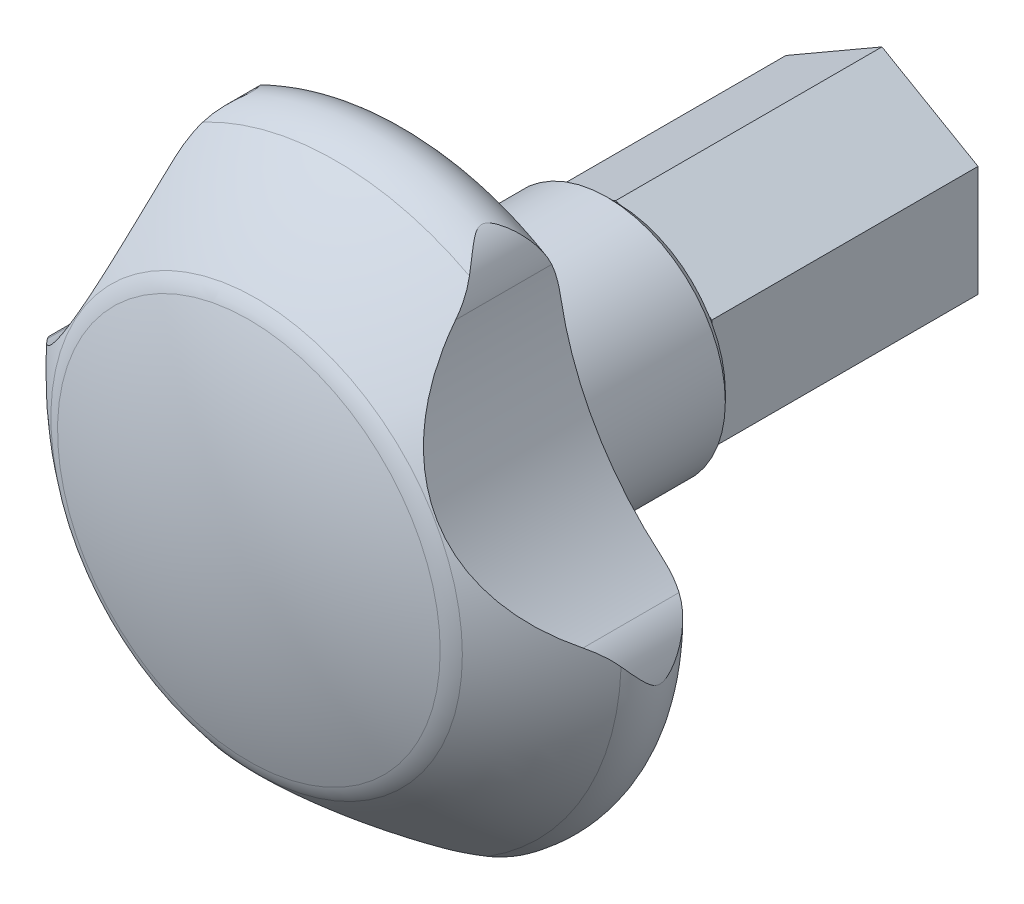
ISO-10303-21;
HEADER;
FILE_DESCRIPTION(('STEP AP214'),'2;1');
FILE_NAME('part.step','',(''),(''),'','','');
FILE_SCHEMA(('AUTOMOTIVE_DESIGN { 1 0 10303 214 1 1 1 1 }'));
ENDSEC;
DATA;
#1=APPLICATION_CONTEXT('core data for automotive mechanical design processes');
#2=APPLICATION_PROTOCOL_DEFINITION('international standard','automotive_design',2000,#1);
#3=PRODUCT_CONTEXT('',#1,'mechanical');
#4=PRODUCT('Part','Part','',(#3));
#5=PRODUCT_RELATED_PRODUCT_CATEGORY('part','',(#4));
#6=PRODUCT_DEFINITION_FORMATION('','',#4);
#7=PRODUCT_DEFINITION_CONTEXT('part definition',#1,'design');
#8=PRODUCT_DEFINITION('design','',#6,#7);
#9=PRODUCT_DEFINITION_SHAPE('','',#8);
#10=(LENGTH_UNIT() NAMED_UNIT(*) SI_UNIT(.MILLI.,.METRE.));
#11=(NAMED_UNIT(*) PLANE_ANGLE_UNIT() SI_UNIT($,.RADIAN.));
#12=(NAMED_UNIT(*) SI_UNIT($,.STERADIAN.) SOLID_ANGLE_UNIT());
#13=UNCERTAINTY_MEASURE_WITH_UNIT(LENGTH_MEASURE(1.E-05),#10,'distance_accuracy_value','');
#14=(GEOMETRIC_REPRESENTATION_CONTEXT(3) GLOBAL_UNCERTAINTY_ASSIGNED_CONTEXT((#13)) GLOBAL_UNIT_ASSIGNED_CONTEXT((#10,
#11,#12)) REPRESENTATION_CONTEXT('',''));
#15=CARTESIAN_POINT('',(0.,0.,0.));
#16=DIRECTION('',(0.,0.,1.));
#17=DIRECTION('',(1.,0.,0.));
#18=AXIS2_PLACEMENT_3D('',#15,#16,#17);
#19=CARTESIAN_POINT('',(0.,8.,18.));
#20=DIRECTION('',(0.,0.,-1.));
#21=DIRECTION('',(-1.,0.,0.));
#22=AXIS2_PLACEMENT_3D('',#19,#20,#21);
#23=PLANE('',#22);
#24=DIRECTION('',(0.,-1.,0.));
#25=VECTOR('',#24,1.);
#26=CARTESIAN_POINT('',(-6.5,3.75277674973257,18.));
#27=LINE('',#26,#25);
#28=CARTESIAN_POINT('',(-6.5,3.75277674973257,18.));
#29=VERTEX_POINT('',#28);
#30=CARTESIAN_POINT('',(-6.5,3.53694783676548,18.));
#31=VERTEX_POINT('',#30);
#32=EDGE_CURVE('E199',#29,#31,#27,.T.);
#33=ORIENTED_EDGE('',*,*,#32,.T.);
#34=CARTESIAN_POINT('',(0.,0.,18.));
#35=DIRECTION('',(0.,0.,1.));
#36=DIRECTION('',(1.,0.,0.));
#37=AXIS2_PLACEMENT_3D('',#34,#35,#36);
#38=CIRCLE('',#37,7.4);
#39=CARTESIAN_POINT('',(-6.31308667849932,3.86069120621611,18.));
#40=VERTEX_POINT('',#39);
#41=EDGE_CURVE('E435',#40,#31,#38,.T.);
#42=ORIENTED_EDGE('',*,*,#41,.F.);
#43=DIRECTION('',(-0.866025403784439,-0.5,0.));
#44=VECTOR('',#43,1.);
#45=CARTESIAN_POINT('',(0.,7.50555349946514,18.));
#46=LINE('',#45,#44);
#47=EDGE_CURVE('E233',#40,#29,#46,.T.);
#48=ORIENTED_EDGE('',*,*,#47,.T.);
#49=EDGE_LOOP('',(#33,#42,#48));
#50=FACE_BOUND('',#49,.T.);
#51=ADVANCED_FACE('F14',(#50),#23,.F.);
#52=DIRECTION('',(-0.866025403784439,0.5,0.));
#53=VECTOR('',#52,1.);
#54=CARTESIAN_POINT('',(6.5,3.75277674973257,18.));
#55=LINE('',#54,#53);
#56=CARTESIAN_POINT('',(0.186913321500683,7.39763904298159,18.));
#57=VERTEX_POINT('',#56);
#58=CARTESIAN_POINT('',(0.,7.50555349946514,18.));
#59=VERTEX_POINT('',#58);
#60=EDGE_CURVE('E229',#57,#59,#55,.T.);
#61=ORIENTED_EDGE('',*,*,#60,.T.);
#62=CARTESIAN_POINT('',(-0.186913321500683,7.39763904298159,18.));
#63=VERTEX_POINT('',#62);
#64=EDGE_CURVE('E235',#59,#63,#46,.T.);
#65=ORIENTED_EDGE('',*,*,#64,.T.);
#66=EDGE_CURVE('E308',#57,#63,#38,.T.);
#67=ORIENTED_EDGE('',*,*,#66,.F.);
#68=EDGE_LOOP('',(#61,#65,#67));
#69=FACE_BOUND('',#68,.T.);
#70=ADVANCED_FACE('F492',(#69),#23,.F.);
#71=CARTESIAN_POINT('',(6.5,3.75277674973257,18.));
#72=VERTEX_POINT('',#71);
#73=CARTESIAN_POINT('',(6.31308667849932,3.86069120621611,18.));
#74=VERTEX_POINT('',#73);
#75=EDGE_CURVE('E230',#72,#74,#55,.T.);
#76=ORIENTED_EDGE('',*,*,#75,.T.);
#77=CARTESIAN_POINT('',(6.5,3.53694783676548,18.));
#78=VERTEX_POINT('',#77);
#79=EDGE_CURVE('E428',#78,#74,#38,.T.);
#80=ORIENTED_EDGE('',*,*,#79,.F.);
#81=DIRECTION('',(0.,1.,0.));
#82=VECTOR('',#81,1.);
#83=CARTESIAN_POINT('',(6.5,-3.75277674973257,18.));
#84=LINE('',#83,#82);
#85=EDGE_CURVE('E224',#78,#72,#84,.T.);
#86=ORIENTED_EDGE('',*,*,#85,.T.);
#87=EDGE_LOOP('',(#76,#80,#86));
#88=FACE_BOUND('',#87,.T.);
#89=ADVANCED_FACE('F499',(#88),#23,.F.);
#90=CARTESIAN_POINT('',(6.5,-3.75277674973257,18.));
#91=VERTEX_POINT('',#90);
#92=CARTESIAN_POINT('',(6.5,-3.53694783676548,18.));
#93=VERTEX_POINT('',#92);
#94=EDGE_CURVE('E226',#91,#93,#84,.T.);
#95=ORIENTED_EDGE('',*,*,#94,.T.);
#96=CARTESIAN_POINT('',(6.31308667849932,-3.86069120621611,18.));
#97=VERTEX_POINT('',#96);
#98=EDGE_CURVE('E450',#97,#93,#38,.T.);
#99=ORIENTED_EDGE('',*,*,#98,.F.);
#100=DIRECTION('',(0.866025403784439,0.5,0.));
#101=VECTOR('',#100,1.);
#102=CARTESIAN_POINT('',(0.,-7.50555349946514,18.));
#103=LINE('',#102,#101);
#104=EDGE_CURVE('E220',#97,#91,#103,.T.);
#105=ORIENTED_EDGE('',*,*,#104,.T.);
#106=EDGE_LOOP('',(#95,#99,#105));
#107=FACE_BOUND('',#106,.T.);
#108=ADVANCED_FACE('F463',(#107),#23,.F.);
#109=CARTESIAN_POINT('',(0.,-7.50555349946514,18.));
#110=VERTEX_POINT('',#109);
#111=CARTESIAN_POINT('',(0.186913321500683,-7.39763904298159,18.));
#112=VERTEX_POINT('',#111);
#113=EDGE_CURVE('E188',#110,#112,#103,.T.);
#114=ORIENTED_EDGE('',*,*,#113,.T.);
#115=CARTESIAN_POINT('',(-0.186913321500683,-7.39763904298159,18.));
#116=VERTEX_POINT('',#115);
#117=EDGE_CURVE('E445',#116,#112,#38,.T.);
#118=ORIENTED_EDGE('',*,*,#117,.F.);
#119=DIRECTION('',(0.866025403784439,-0.5,0.));
#120=VECTOR('',#119,1.);
#121=CARTESIAN_POINT('',(-6.5,-3.75277674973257,18.));
#122=LINE('',#121,#120);
#123=EDGE_CURVE('E222',#116,#110,#122,.T.);
#124=ORIENTED_EDGE('',*,*,#123,.T.);
#125=EDGE_LOOP('',(#114,#118,#124));
#126=FACE_BOUND('',#125,.T.);
#127=ADVANCED_FACE('F468',(#126),#23,.F.);
#128=CARTESIAN_POINT('',(-6.5,-3.53694783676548,18.));
#129=VERTEX_POINT('',#128);
#130=CARTESIAN_POINT('',(-6.5,-3.75277674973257,18.));
#131=VERTEX_POINT('',#130);
#132=EDGE_CURVE('E238',#129,#131,#27,.T.);
#133=ORIENTED_EDGE('',*,*,#132,.T.);
#134=CARTESIAN_POINT('',(-6.31308667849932,-3.86069120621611,18.));
#135=VERTEX_POINT('',#134);
#136=EDGE_CURVE('E217',#131,#135,#122,.T.);
#137=ORIENTED_EDGE('',*,*,#136,.T.);
#138=EDGE_CURVE('E440',#129,#135,#38,.T.);
#139=ORIENTED_EDGE('',*,*,#138,.F.);
#140=EDGE_LOOP('',(#133,#137,#139));
#141=FACE_BOUND('',#140,.T.);
#142=ADVANCED_FACE('F494',(#141),#23,.F.);
#143=CARTESIAN_POINT('',(0.,0.,34.875));
#144=DIRECTION('',(0.,0.,1.));
#145=DIRECTION('',(1.,0.,0.));
#146=AXIS2_PLACEMENT_3D('',#143,#144,#145);
#147=TOROIDAL_SURFACE('',#146,16.625,3.375);
#148=CARTESIAN_POINT('',(0.,0.,31.5));
#149=DIRECTION('',(0.,0.,1.));
#150=DIRECTION('',(1.,0.,0.));
#151=AXIS2_PLACEMENT_3D('',#148,#149,#150);
#152=CIRCLE('',#151,16.625);
#153=CARTESIAN_POINT('',(6.77428745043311,-15.1822150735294,31.5));
#154=VERTEX_POINT('',#153);
#155=CARTESIAN_POINT('',(16.5353276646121,1.72440251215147,31.5));
#156=VERTEX_POINT('',#155);
#157=EDGE_CURVE('E411',#154,#156,#152,.T.);
#158=ORIENTED_EDGE('',*,*,#157,.T.);
#159=CARTESIAN_POINT('',(9.50595479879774,15.4379786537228,31.8541043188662));
#160=CARTESIAN_POINT('',(9.51645099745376,15.3037212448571,31.7998826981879));
#161=CARTESIAN_POINT('',(9.52855229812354,15.1669261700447,31.7526191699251));
#162=CARTESIAN_POINT('',(9.55598611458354,14.8901147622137,31.6711535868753));
#163=CARTESIAN_POINT('',(9.5713116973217,14.7501059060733,31.636923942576));
#164=CARTESIAN_POINT('',(9.60499380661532,14.4703418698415,31.5808904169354));
#165=CARTESIAN_POINT('',(9.62329916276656,14.3306169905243,31.5589005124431));
#166=CARTESIAN_POINT('',(9.66307090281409,14.0503009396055,31.5254626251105));
#167=CARTESIAN_POINT('',(9.68453925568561,13.9097092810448,31.5140212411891));
#168=CARTESIAN_POINT('',(9.74171564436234,13.5604307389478,31.4973647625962));
#169=CARTESIAN_POINT('',(9.77928160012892,13.3517720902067,31.4978565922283));
#170=CARTESIAN_POINT('',(9.86087598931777,12.9364664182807,31.5161913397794));
#171=CARTESIAN_POINT('',(9.90490908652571,12.7298209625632,31.5340468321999));
#172=CARTESIAN_POINT('',(9.99957784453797,12.3174684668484,31.5840167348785));
#173=CARTESIAN_POINT('',(10.0502797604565,12.1117957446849,31.6162832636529));
#174=CARTESIAN_POINT('',(10.1575906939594,11.7042001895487,31.6918190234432));
#175=CARTESIAN_POINT('',(10.214197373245,11.5022759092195,31.7350839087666));
#176=CARTESIAN_POINT('',(10.3686503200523,10.9825776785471,31.8577332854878));
#177=CARTESIAN_POINT('',(10.4709447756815,10.6675934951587,31.9432631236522));
#178=CARTESIAN_POINT('',(10.6354539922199,10.2004875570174,32.077143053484));
#179=CARTESIAN_POINT('',(10.6921878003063,10.0455515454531,32.1227415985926));
#180=CARTESIAN_POINT('',(10.8094624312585,9.73714627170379,32.2140018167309));
#181=CARTESIAN_POINT('',(10.870002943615,9.58367689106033,32.2596634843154));
#182=CARTESIAN_POINT('',(10.9941316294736,9.28009247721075,32.3483981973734));
#183=CARTESIAN_POINT('',(11.0576605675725,9.12996163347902,32.3914997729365));
#184=CARTESIAN_POINT('',(11.18881084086,8.83034428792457,32.4736703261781));
#185=CARTESIAN_POINT('',(11.2564325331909,8.68085784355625,32.5127389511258));
#186=CARTESIAN_POINT('',(11.3958170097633,8.38263736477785,32.5843050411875));
#187=CARTESIAN_POINT('',(11.4675701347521,8.23390239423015,32.616817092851));
#188=CARTESIAN_POINT('',(11.615455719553,7.93690468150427,32.6727872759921));
#189=CARTESIAN_POINT('',(11.6915867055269,7.78864179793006,32.6962484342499));
#190=CARTESIAN_POINT('',(11.8236597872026,7.53921789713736,32.7262894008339));
#191=CARTESIAN_POINT('',(11.8784750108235,7.43781839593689,32.7358536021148));
#192=CARTESIAN_POINT('',(11.9900171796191,7.23569510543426,32.7491398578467));
#193=CARTESIAN_POINT('',(12.0467439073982,7.13497124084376,32.7528625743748));
#194=CARTESIAN_POINT('',(12.1619688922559,6.93446874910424,32.754255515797));
#195=CARTESIAN_POINT('',(12.2204675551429,6.83469034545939,32.7519243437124));
#196=CARTESIAN_POINT('',(12.3390439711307,6.63639652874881,32.7413391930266));
#197=CARTESIAN_POINT('',(12.3991217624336,6.53788114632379,32.7330850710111));
#198=CARTESIAN_POINT('',(12.5213047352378,6.34135670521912,32.7109864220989));
#199=CARTESIAN_POINT('',(12.583424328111,6.24336300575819,32.6970858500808));
#200=CARTESIAN_POINT('',(12.7089780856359,6.04904039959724,32.6643869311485));
#201=CARTESIAN_POINT('',(12.772412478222,5.95271178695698,32.6455877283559));
#202=CARTESIAN_POINT('',(12.9646113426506,5.6662360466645,32.5830663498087));
#203=CARTESIAN_POINT('',(13.0952277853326,5.47866922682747,32.5332294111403));
#204=CARTESIAN_POINT('',(13.3299828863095,5.1534466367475,32.4369316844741));
#205=CARTESIAN_POINT('',(13.4331124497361,5.01443996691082,32.3924401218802));
#206=CARTESIAN_POINT('',(13.6424793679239,4.73971969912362,32.3006111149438));
#207=CARTESIAN_POINT('',(13.7487170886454,4.60400649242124,32.2532733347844));
#208=CARTESIAN_POINT('',(13.9646299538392,4.3354008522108,32.1580853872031));
#209=CARTESIAN_POINT('',(14.0743068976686,4.20250995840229,32.1102349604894));
#210=CARTESIAN_POINT('',(14.2973419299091,3.93928289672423,32.0161154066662));
#211=CARTESIAN_POINT('',(14.4107001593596,3.80894682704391,31.969846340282));
#212=CARTESIAN_POINT('',(14.7552752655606,3.42301483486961,31.8368224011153));
#213=CARTESIAN_POINT('',(14.9923790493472,3.1707686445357,31.7551864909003));
#214=CARTESIAN_POINT('',(15.4831619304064,2.67547480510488,31.6198975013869));
#215=CARTESIAN_POINT('',(15.7368100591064,2.43241124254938,31.5661937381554));
#216=CARTESIAN_POINT('',(16.2307686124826,1.98381655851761,31.505103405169));
#217=CARTESIAN_POINT('',(16.4693787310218,1.77713561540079,31.4931932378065));
#218=CARTESIAN_POINT('',(16.8333634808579,1.47663315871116,31.5091853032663));
#219=CARTESIAN_POINT('',(16.955640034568,1.37809953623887,31.5201448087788));
#220=CARTESIAN_POINT('',(17.2013258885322,1.18481238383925,31.5547877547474));
#221=CARTESIAN_POINT('',(17.3247344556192,1.09005659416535,31.5784634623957));
#222=CARTESIAN_POINT('',(17.5613943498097,0.912640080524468,31.6374382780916));
#223=CARTESIAN_POINT('',(17.674651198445,0.829623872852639,31.6716288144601));
#224=CARTESIAN_POINT('',(17.8999656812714,0.667982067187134,31.752932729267));
#225=CARTESIAN_POINT('',(18.0120207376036,0.589364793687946,31.8000696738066));
#226=CARTESIAN_POINT('',(18.1226937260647,0.513385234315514,31.8541212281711));
#227=B_SPLINE_CURVE_WITH_KNOTS('',3,(#159,#160,#161,#162,#163,#164,#165,#166,#167,#168,#169,
#170,#171,#172,#173,#174,#175,#176,#177,#178,#179,#180,#181,#182,#183,#184,#185,#186,#187,#188,
#189,#190,#191,#192,#193,#194,#195,#196,#197,#198,#199,#200,#201,#202,#203,#204,#205,#206,#207,
#208,#209,#210,#211,#212,#213,#214,#215,#216,#217,#218,#219,#220,#221,#222,#223,#224,#225,#226),
.UNSPECIFIED.,.F.,.F.,(4,2,2,2,2,2,2,2,2,2,2,2,2,2,2,2,2,2,2,2,2,2,2,2,2,2,2,2,2,2,2,2,2,4),(0.,
0.43512627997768,0.869326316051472,1.29673327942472,1.72440743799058,2.35940170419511,
2.99485616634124,3.63718292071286,4.27925627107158,5.30456736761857,5.81809451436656,
6.33157982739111,6.83737353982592,7.3432114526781,7.84791129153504,8.35244220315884,
8.69928448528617,9.04608745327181,9.392970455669,9.73986185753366,10.0902839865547,
10.4407673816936,11.1419829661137,11.6780504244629,12.2141812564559,12.7505974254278,
13.2870341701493,14.352982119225,15.4169890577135,16.3615250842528,16.8333167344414,
17.3048218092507,17.7377773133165,18.1715262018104),.UNSPECIFIED.);
#228=CARTESIAN_POINT('',(18.1224937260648,0.513522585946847,31.8540235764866));
#229=VERTEX_POINT('',#228);
#230=EDGE_CURVE('E837',#156,#229,#227,.T.);
#231=ORIENTED_EDGE('',*,*,#230,.T.);
#232=CARTESIAN_POINT('',(19.283269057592,-0.717939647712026,36.9372855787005));
#233=CARTESIAN_POINT('',(19.3432732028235,-0.817379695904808,36.8547398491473));
#234=CARTESIAN_POINT('',(19.3981162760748,-0.918151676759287,36.7701037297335));
#235=CARTESIAN_POINT('',(19.4978445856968,-1.1211185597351,36.5964609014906));
#236=CARTESIAN_POINT('',(19.542716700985,-1.22331515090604,36.5074486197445));
#237=CARTESIAN_POINT('',(19.6228738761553,-1.42803648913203,36.3247100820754));
#238=CARTESIAN_POINT('',(19.6581193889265,-1.53056088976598,36.2309662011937));
#239=CARTESIAN_POINT('',(19.7190946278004,-1.73342148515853,36.0382835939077));
#240=CARTESIAN_POINT('',(19.7448338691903,-1.83375977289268,35.9393501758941));
#241=CARTESIAN_POINT('',(19.7784353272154,-1.98769365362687,35.7764480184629));
#242=CARTESIAN_POINT('',(19.7892799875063,-2.0433693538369,35.7150559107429));
#243=CARTESIAN_POINT('',(19.8080166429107,-2.15093749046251,35.5883776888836));
#244=CARTESIAN_POINT('',(19.8159051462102,-2.20282539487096,35.5230870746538));
#245=CARTESIAN_POINT('',(19.8273856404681,-2.28824219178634,35.4024524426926));
#246=CARTESIAN_POINT('',(19.8315471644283,-2.3232595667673,35.3482347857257));
#247=CARTESIAN_POINT('',(19.838274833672,-2.38559928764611,35.2354516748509));
#248=CARTESIAN_POINT('',(19.8408474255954,-2.41295247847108,35.176904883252));
#249=CARTESIAN_POINT('',(19.8438432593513,-2.44702991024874,35.0774131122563));
#250=CARTESIAN_POINT('',(19.8447083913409,-2.45763985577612,35.0378536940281));
#251=CARTESIAN_POINT('',(19.845861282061,-2.47204410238,34.9575226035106));
#252=CARTESIAN_POINT('',(19.846150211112,-2.47585221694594,34.9167535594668));
#253=CARTESIAN_POINT('',(19.8461593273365,-2.47597002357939,34.8350870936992));
#254=CARTESIAN_POINT('',(19.8458778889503,-2.47225828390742,34.7941896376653));
#255=CARTESIAN_POINT('',(19.8447369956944,-2.45799115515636,34.7136041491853));
#256=CARTESIAN_POINT('',(19.8438764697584,-2.44742308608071,34.6739185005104));
#257=CARTESIAN_POINT('',(19.8408842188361,-2.41334829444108,34.5739658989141));
#258=CARTESIAN_POINT('',(19.8383048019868,-2.38589255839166,34.5151006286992));
#259=CARTESIAN_POINT('',(19.8315461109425,-2.32323413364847,34.4016974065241));
#260=CARTESIAN_POINT('',(19.8273592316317,-2.28799496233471,34.3471815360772));
#261=CARTESIAN_POINT('',(19.8139941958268,-2.18869181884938,34.2069806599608));
#262=CARTESIAN_POINT('',(19.8033419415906,-2.12082733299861,34.124178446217));
#263=CARTESIAN_POINT('',(19.7770498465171,-1.97976151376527,33.9640106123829));
#264=CARTESIAN_POINT('',(19.7613983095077,-1.90654797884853,33.8866582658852));
#265=CARTESIAN_POINT('',(19.7248160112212,-1.75721668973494,33.7354478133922));
#266=CARTESIAN_POINT('',(19.7038632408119,-1.68108797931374,33.6616058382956));
#267=CARTESIAN_POINT('',(19.6565654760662,-1.52779023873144,33.516967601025));
#268=CARTESIAN_POINT('',(19.6302255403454,-1.4506222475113,33.4461685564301));
#269=CARTESIAN_POINT('',(19.5601947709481,-1.26477650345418,33.2789509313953));
#270=CARTESIAN_POINT('',(19.5137969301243,-1.15599243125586,33.183766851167));
#271=CARTESIAN_POINT('',(19.4096394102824,-0.939748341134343,32.9980805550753));
#272=CARTESIAN_POINT('',(19.3518729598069,-0.832289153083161,32.9075811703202));
#273=CARTESIAN_POINT('',(19.2249839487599,-0.620747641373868,32.7320768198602));
#274=CARTESIAN_POINT('',(19.1559241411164,-0.516650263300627,32.6470449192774));
#275=CARTESIAN_POINT('',(19.0059521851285,-0.312627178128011,32.4826320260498));
#276=CARTESIAN_POINT('',(18.9250411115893,-0.212701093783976,32.4032505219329));
#277=CARTESIAN_POINT('',(18.7358268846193,-0.00138540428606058,32.2377557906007));
#278=CARTESIAN_POINT('',(18.6252079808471,0.108951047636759,32.1528947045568));
#279=CARTESIAN_POINT('',(18.4464783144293,0.266841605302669,32.0340195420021));
#280=CARTESIAN_POINT('',(18.3846072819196,0.318314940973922,31.9957170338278));
#281=CARTESIAN_POINT('',(18.2566207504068,0.418305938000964,31.9223190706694));
#282=CARTESIAN_POINT('',(18.1905018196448,0.466821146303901,31.8872262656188));
#283=CARTESIAN_POINT('',(18.1222937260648,0.513659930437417,31.8539259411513));
#284=B_SPLINE_CURVE_WITH_KNOTS('',3,(#232,#233,#234,#235,#236,#237,#238,#239,#240,#241,#242,
#243,#244,#245,#246,#247,#248,#249,#250,#251,#252,#253,#254,#255,#256,#257,#258,#259,#260,#261,
#262,#263,#264,#265,#266,#267,#268,#269,#270,#271,#272,#273,#274,#275,#276,#277,#278,#279,#280,
#281,#282,#283),.UNSPECIFIED.,.F.,.F.,(4,2,2,2,2,2,2,2,2,2,2,2,2,2,2,2,2,2,2,2,2,2,2,2,2,4),(0.,
0.427303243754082,0.855165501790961,1.28475989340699,1.71392311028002,1.96454612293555,
2.21546424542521,2.4091715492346,2.60208768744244,2.72451026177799,2.84668393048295,
2.96920628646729,3.0919558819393,3.28584516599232,3.48066330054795,3.80264986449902,
4.12539532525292,4.44950336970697,4.77330845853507,5.22823009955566,5.68342352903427,
6.13616858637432,6.58887260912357,7.12078121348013,7.38799711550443,7.65543167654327),.UNSPECIFIED.);
#285=CARTESIAN_POINT('',(19.2834145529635,-0.718180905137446,36.9370855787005));
#286=VERTEX_POINT('',#285);
#287=EDGE_CURVE('E854',#286,#229,#284,.T.);
#288=ORIENTED_EDGE('',*,*,#287,.F.);
#289=CARTESIAN_POINT('',(0.,0.,36.9370855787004));
#290=DIRECTION('',(0.,0.,1.));
#291=DIRECTION('',(1.,0.,0.));
#292=AXIS2_PLACEMENT_3D('',#289,#290,#291);
#293=CIRCLE('',#292,19.2967836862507);
#294=CARTESIAN_POINT('',(10.2636701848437,-16.3408364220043,36.9370855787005));
#295=VERTEX_POINT('',#294);
#296=EDGE_CURVE('E407',#295,#286,#293,.T.);
#297=ORIENTED_EDGE('',*,*,#296,.F.);
#298=CARTESIAN_POINT('',(8.61632325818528,-15.9512057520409,31.85393438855));
#299=CARTESIAN_POINT('',(8.73799434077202,-16.0093028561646,31.9082231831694));
#300=CARTESIAN_POINT('',(8.86072630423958,-16.060350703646,31.9672208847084));
#301=CARTESIAN_POINT('',(9.10667626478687,-16.1489720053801,32.0931003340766));
#302=CARTESIAN_POINT('',(9.22989267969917,-16.1865737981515,32.1599651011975));
#303=CARTESIAN_POINT('',(9.47514620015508,-16.2490254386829,32.2999689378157));
#304=CARTESIAN_POINT('',(9.59718611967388,-16.2739323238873,32.3730781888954));
#305=CARTESIAN_POINT('',(9.8396693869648,-16.312066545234,32.5248830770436));
#306=CARTESIAN_POINT('',(9.96011181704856,-16.3252874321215,32.6035817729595));
#307=CARTESIAN_POINT('',(10.2078052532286,-16.3414570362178,32.7722047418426));
#308=CARTESIAN_POINT('',(10.3348436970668,-16.3435129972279,32.8625247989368));
#309=CARTESIAN_POINT('',(10.5848023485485,-16.336009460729,33.0482599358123));
#310=CARTESIAN_POINT('',(10.7077216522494,-16.3264474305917,33.1436761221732));
#311=CARTESIAN_POINT('',(10.9479894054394,-16.2969095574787,33.3394481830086));
#312=CARTESIAN_POINT('',(11.0653442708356,-16.2769460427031,33.4397980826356));
#313=CARTESIAN_POINT('',(11.2928347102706,-16.2281050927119,33.6462350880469));
#314=CARTESIAN_POINT('',(11.4029764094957,-16.1992353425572,33.7523171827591));
#315=CARTESIAN_POINT('',(11.5664047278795,-16.1493571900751,33.9245079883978));
#316=CARTESIAN_POINT('',(11.6234147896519,-16.1304655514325,33.9877083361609));
#317=CARTESIAN_POINT('',(11.7327235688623,-16.0916521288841,34.1179814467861));
#318=CARTESIAN_POINT('',(11.7850174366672,-16.071729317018,34.1850580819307));
#319=CARTESIAN_POINT('',(11.8722875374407,-16.0366015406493,34.3108301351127));
#320=CARTESIAN_POINT('',(11.9086355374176,-16.0212499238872,34.3685187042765));
#321=CARTESIAN_POINT('',(11.973373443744,-15.9929667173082,34.4887986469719));
#322=CARTESIAN_POINT('',(12.0017938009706,-15.9800259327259,34.5513700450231));
#323=CARTESIAN_POINT('',(12.0363977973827,-15.9639727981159,34.6554709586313));
#324=CARTESIAN_POINT('',(12.0469244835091,-15.9590035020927,34.6952167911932));
#325=CARTESIAN_POINT('',(12.0618077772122,-15.9519431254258,34.7760642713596));
#326=CARTESIAN_POINT('',(12.0661796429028,-15.9498449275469,34.8171623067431));
#327=CARTESIAN_POINT('',(12.0680139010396,-15.9489671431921,34.8997426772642));
#328=CARTESIAN_POINT('',(12.0654453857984,-15.9502024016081,34.9412259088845));
#329=CARTESIAN_POINT('',(12.0538107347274,-15.9557420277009,35.0230710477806));
#330=CARTESIAN_POINT('',(12.0447329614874,-15.9600518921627,35.0634308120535));
#331=CARTESIAN_POINT('',(12.015468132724,-15.9737226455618,35.1624272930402));
#332=CARTESIAN_POINT('',(11.9919731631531,-15.9845397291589,35.2198462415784));
#333=CARTESIAN_POINT('',(11.9375757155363,-16.0087265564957,35.3305586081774));
#334=CARTESIAN_POINT('',(11.9066365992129,-16.0221088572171,35.383829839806));
#335=CARTESIAN_POINT('',(11.8191710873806,-16.0584086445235,35.519682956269));
#336=CARTESIAN_POINT('',(11.7588131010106,-16.0820171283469,35.5995627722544));
#337=CARTESIAN_POINT('',(11.6311833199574,-16.1279945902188,35.7540647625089));
#338=CARTESIAN_POINT('',(11.563895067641,-16.1503604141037,35.8286736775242));
#339=CARTESIAN_POINT('',(11.424378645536,-16.1924155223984,35.9744739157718));
#340=CARTESIAN_POINT('',(11.3521330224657,-16.2120945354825,36.0456514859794));
#341=CARTESIAN_POINT('',(11.2041859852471,-16.2477973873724,36.1850918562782));
#342=CARTESIAN_POINT('',(11.1284884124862,-16.26382517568,36.2533577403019));
#343=CARTESIAN_POINT('',(10.9885286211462,-16.2891263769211,36.3750655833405));
#344=CARTESIAN_POINT('',(10.9247435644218,-16.2991008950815,36.4289123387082));
#345=CARTESIAN_POINT('',(10.795535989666,-16.3160522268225,36.535121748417));
#346=CARTESIAN_POINT('',(10.7301131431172,-16.3230284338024,36.5874841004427));
#347=CARTESIAN_POINT('',(10.5984732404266,-16.3337316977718,36.690270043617));
#348=CARTESIAN_POINT('',(10.5322690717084,-16.3374881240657,36.7407070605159));
#349=CARTESIAN_POINT('',(10.3986745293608,-16.3416872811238,36.8401074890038));
#350=CARTESIAN_POINT('',(10.331284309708,-16.3421304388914,36.8890710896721));
#351=CARTESIAN_POINT('',(10.2633885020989,-16.3408310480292,36.9372855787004));
#352=B_SPLINE_CURVE_WITH_KNOTS('',3,(#298,#299,#300,#301,#302,#303,#304,#305,#306,#307,#308,
#309,#310,#311,#312,#313,#314,#315,#316,#317,#318,#319,#320,#321,#322,#323,#324,#325,#326,#327,
#328,#329,#330,#331,#332,#333,#334,#335,#336,#337,#338,#339,#340,#341,#342,#343,#344,#345,#346,
#347,#348,#349,#350,#351),.UNSPECIFIED.,.F.,.F.,(4,2,2,2,2,2,2,2,2,2,2,2,2,2,2,2,2,2,2,2,2,2,2,
2,2,2,4),(0.,0.435551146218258,0.870178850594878,1.30283619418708,1.73573216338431,
2.20278289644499,2.66993546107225,3.13653559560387,3.60273422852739,3.86416270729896,
4.12585701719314,4.33521208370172,4.54375156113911,4.66753533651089,4.79101170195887,
4.91503885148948,5.03928829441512,5.22712917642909,5.41591418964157,5.72375561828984,
6.03234572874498,6.34208434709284,6.65148631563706,6.90361247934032,7.15578962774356,
7.40564128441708,7.65546074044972),.UNSPECIFIED.);
#353=CARTESIAN_POINT('',(8.61652325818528,-15.9513012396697,31.8540235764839));
#354=VERTEX_POINT('',#353);
#355=EDGE_CURVE('E860',#354,#295,#352,.T.);
#356=ORIENTED_EDGE('',*,*,#355,.F.);
#357=CARTESIAN_POINT('',(8.61672325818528,-15.9513967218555,31.8541127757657));
#358=CARTESIAN_POINT('',(8.49520512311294,-15.8933579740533,31.7998904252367));
#359=CARTESIAN_POINT('',(8.37068671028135,-15.8354404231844,31.7526261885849));
#360=CARTESIAN_POINT('',(8.11724451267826,-15.7207929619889,31.671159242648));
#361=CARTESIAN_POINT('',(7.98833066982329,-15.6640607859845,31.6369289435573));
#362=CARTESIAN_POINT('',(7.72920714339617,-15.553348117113,31.5808941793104));
#363=CARTESIAN_POINT('',(7.59904928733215,-15.4993384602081,31.5589036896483));
#364=CARTESIAN_POINT('',(7.33640278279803,-15.3936235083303,31.5254646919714));
#365=CARTESIAN_POINT('',(7.20391272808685,-15.3419196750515,31.5140227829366));
#366=CARTESIAN_POINT('',(6.87284203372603,-15.2167967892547,31.4973651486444));
#367=CARTESIAN_POINT('',(6.67335688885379,-15.1450008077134,31.4978562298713));
#368=CARTESIAN_POINT('',(6.27289743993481,-15.0080112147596,31.516189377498));
#369=CARTESIAN_POINT('',(6.07192216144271,-14.9428224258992,31.5340440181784));
#370=CARTESIAN_POINT('',(5.66748299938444,-14.8186319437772,31.58401216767));
#371=CARTESIAN_POINT('',(5.46401570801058,-14.7597047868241,31.6162777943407));
#372=CARTESIAN_POINT('',(5.0573750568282,-14.648841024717,31.6918117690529));
#373=CARTESIAN_POINT('',(4.85420161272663,-14.59690167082,31.7350757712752));
#374=CARTESIAN_POINT('',(4.32690041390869,-14.4708109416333,31.8577245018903));
#375=CARTESIAN_POINT('',(4.00296459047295,-14.4019069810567,31.9432550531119));
#376=CARTESIAN_POINT('',(3.51617796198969,-14.310821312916,32.0771364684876));
#377=CARTESIAN_POINT('',(3.35363039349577,-14.2824856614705,32.1227355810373));
#378=CARTESIAN_POINT('',(3.02790199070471,-14.2298448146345,32.2139970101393));
#379=CARTESIAN_POINT('',(2.8647212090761,-14.2055392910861,32.25965932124));
#380=CARTESIAN_POINT('',(2.53974081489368,-14.1612448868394,32.3483953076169));
#381=CARTESIAN_POINT('',(2.37795712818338,-14.1411967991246,32.3914975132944));
#382=CARTESIAN_POINT('',(2.05290153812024,-14.1049670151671,32.4736692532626));
#383=CARTESIAN_POINT('',(1.88962950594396,-14.0887856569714,32.5127384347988));
#384=CARTESIAN_POINT('',(1.56166647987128,-14.0603855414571,32.584305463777));
#385=CARTESIAN_POINT('',(1.39697950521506,-14.0481579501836,32.6168178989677));
#386=CARTESIAN_POINT('',(1.06582480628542,-14.0277316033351,32.6727885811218));
#387=CARTESIAN_POINT('',(0.89935769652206,-14.0195315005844,32.6962498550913));
#388=CARTESIAN_POINT('',(0.617310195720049,-14.0091982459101,32.726290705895));
#389=CARTESIAN_POINT('',(0.502086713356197,-14.0059699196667,32.735854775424));
#390=CARTESIAN_POINT('',(0.271269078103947,-14.0015067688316,32.7491406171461));
#391=CARTESIAN_POINT('',(0.155674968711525,-14.0002717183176,32.7528630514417));
#392=CARTESIAN_POINT('',(-0.0755804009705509,-13.9998084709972,32.7542552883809));
#393=CARTESIAN_POINT('',(-0.19124167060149,-14.0005807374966,32.7519236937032));
#394=CARTESIAN_POINT('',(-0.42225994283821,-14.0041243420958,32.7413375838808));
#395=CARTESIAN_POINT('',(-0.53761693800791,-14.0068957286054,32.7330829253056));
#396=CARTESIAN_POINT('',(-0.768906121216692,-14.0144474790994,32.710983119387));
#397=CARTESIAN_POINT('',(-0.884832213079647,-14.0192480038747,32.6970819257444));
#398=CARTESIAN_POINT('',(-1.11589989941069,-14.0308199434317,32.6643817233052));
#399=CARTESIAN_POINT('',(-1.23104135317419,-14.0375917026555,32.6455818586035));
#400=CARTESIAN_POINT('',(-1.57523971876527,-14.0608038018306,32.5830584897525));
#401=CARTESIAN_POINT('',(-1.80298796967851,-14.0801382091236,32.5332202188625));
#402=CARTESIAN_POINT('',(-2.20201415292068,-14.12083142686,32.4369219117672));
#403=CARTESIAN_POINT('',(-2.37395752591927,-14.1406406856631,32.3924312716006));
#404=CARTESIAN_POINT('',(-2.71654638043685,-14.1845969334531,32.3006044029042));
#405=CARTESIAN_POINT('',(-2.88719170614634,-14.2087444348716,32.253267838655));
#406=CARTESIAN_POINT('',(-3.22775824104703,-14.2614264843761,32.1580824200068));
#407=CARTESIAN_POINT('',(-3.39767901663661,-14.2899633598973,32.1102333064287));
#408=CARTESIAN_POINT('',(-3.73714870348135,-14.3515021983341,32.0161162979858));
#409=CARTESIAN_POINT('',(-3.90669760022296,-14.3845043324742,31.9698484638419));
#410=CARTESIAN_POINT('',(-4.41319851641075,-14.4899459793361,31.8368278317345));
#411=CARTESIAN_POINT('',(-4.75019302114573,-14.5691582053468,31.755193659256));
#412=CARTESIAN_POINT('',(-5.42450354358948,-14.7465355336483,31.6199060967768));
#413=CARTESIAN_POINT('',(-5.76181785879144,-14.8446658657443,31.5662020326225));
#414=CARTESIAN_POINT('',(-6.39728605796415,-15.0481450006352,31.5051069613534));
#415=CARTESIAN_POINT('',(-6.69558548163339,-15.1514470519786,31.4931939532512));
#416=CARTESIAN_POINT('',(-7.13782595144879,-15.3164163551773,31.5091819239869));
#417=CARTESIAN_POINT('',(-7.28429865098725,-15.3730443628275,31.5201400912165));
#418=CARTESIAN_POINT('',(-7.57453684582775,-15.4891715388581,31.5547804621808));
#419=CARTESIAN_POINT('',(-7.71830393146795,-15.5486689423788,31.5784549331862));
#420=CARTESIAN_POINT('',(-7.99028741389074,-15.6649160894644,31.6374281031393));
#421=CARTESIAN_POINT('',(-8.11881435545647,-15.721492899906,31.6716184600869));
#422=CARTESIAN_POINT('',(-8.37146611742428,-15.8358034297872,31.7529227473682));
#423=CARTESIAN_POINT('',(-8.49558243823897,-15.8935390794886,31.8000602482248));
#424=CARTESIAN_POINT('',(-8.6167232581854,-15.9513967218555,31.8541127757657));
#425=B_SPLINE_CURVE_WITH_KNOTS('',3,(#357,#358,#359,#360,#361,#362,#363,#364,#365,#366,#367,
#368,#369,#370,#371,#372,#373,#374,#375,#376,#377,#378,#379,#380,#381,#382,#383,#384,#385,#386,
#387,#388,#389,#390,#391,#392,#393,#394,#395,#396,#397,#398,#399,#400,#401,#402,#403,#404,#405,
#406,#407,#408,#409,#410,#411,#412,#413,#414,#415,#416,#417,#418,#419,#420,#421,#422,#423,#424),
.UNSPECIFIED.,.F.,.F.,(4,2,2,2,2,2,2,2,2,2,2,2,2,2,2,2,2,2,2,2,2,2,2,2,2,2,2,2,2,2,2,2,2,4),(0.,
0.435126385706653,0.869326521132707,1.29673356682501,1.72440780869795,2.35939750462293,
2.99484738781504,3.63716950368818,4.27923821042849,5.30456286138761,5.81809684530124,
6.33158899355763,6.83738933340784,7.34323387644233,7.84794026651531,8.35247771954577,
8.69932392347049,9.04613081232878,9.39301775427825,9.73991309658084,10.0903392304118,
10.440826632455,11.1420502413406,11.6781033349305,12.2142197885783,12.7506215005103,
13.2870437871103,14.3529633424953,15.4169421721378,16.3614882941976,16.8332849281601,
17.3047949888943,17.7377638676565,18.1715262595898),.UNSPECIFIED.);
#426=EDGE_CURVE('E865',#354,#154,#425,.T.);
#427=ORIENTED_EDGE('',*,*,#426,.T.);
#428=EDGE_LOOP('',(#158,#231,#288,#297,#356,#427));
#429=FACE_BOUND('',#428,.T.);
#430=ADVANCED_FACE('F503',(#429),#147,.T.);
#431=CARTESIAN_POINT('',(-18.1222937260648,0.513659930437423,31.8539259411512));
#432=CARTESIAN_POINT('',(-18.2334434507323,0.437338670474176,31.9082142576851));
#433=CARTESIAN_POINT('',(-18.3390187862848,0.356573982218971,31.9672115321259));
#434=CARTESIAN_POINT('',(-18.5387433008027,0.187886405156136,32.0930902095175));
#435=CARTESIAN_POINT('',(-18.6329162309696,0.0999790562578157,32.1599546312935));
#436=CARTESIAN_POINT('',(-18.8096288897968,-0.0811903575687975,32.299957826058));
#437=CARTESIAN_POINT('',(-18.8922194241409,-0.174426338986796,32.3730667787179));
#438=CARTESIAN_POINT('',(-19.0464874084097,-0.365355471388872,32.5248711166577));
#439=CARTESIAN_POINT('',(-19.1181588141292,-0.463051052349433,32.6035695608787));
#440=CARTESIAN_POINT('',(-19.256009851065,-0.669474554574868,32.7721918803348));
#441=CARTESIAN_POINT('',(-19.3213100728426,-0.7784647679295,32.8625115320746));
#442=CARTESIAN_POINT('',(-19.4397921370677,-0.998686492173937,33.0482458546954));
#443=CARTESIAN_POINT('',(-19.4929713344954,-1.10991848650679,33.143661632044));
#444=CARTESIAN_POINT('',(-19.5875256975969,-1.33276498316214,33.3394328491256));
#445=CARTESIAN_POINT('',(-19.6289147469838,-1.44437887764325,33.4397823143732));
#446=CARTESIAN_POINT('',(-19.7003635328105,-1.66581169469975,33.6462183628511));
#447=CARTESIAN_POINT('',(-19.730432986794,-1.77563207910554,33.7522999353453));
#448=CARTESIAN_POINT('',(-19.7689524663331,-1.94210548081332,33.9244907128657));
#449=CARTESIAN_POINT('',(-19.7810973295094,-2.00092455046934,33.987691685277));
#450=CARTESIAN_POINT('',(-19.8021391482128,-2.11499770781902,34.117966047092));
#451=CARTESIAN_POINT('',(-19.8110327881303,-2.17024810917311,34.1850433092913));
#452=CARTESIAN_POINT('',(-19.8242469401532,-2.26339292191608,34.3108172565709));
#453=CARTESIAN_POINT('',(-19.8291263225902,-2.30254856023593,34.368507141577));
#454=CARTESIAN_POINT('',(-19.8370017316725,-2.37275774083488,34.4887899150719));
#455=CARTESIAN_POINT('',(-19.8400050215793,-2.40384225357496,34.5513628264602));
#456=CARTESIAN_POINT('',(-19.8434047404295,-2.44183813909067,34.6554654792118));
#457=CARTESIAN_POINT('',(-19.8443645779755,-2.45343948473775,34.6952113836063));
#458=CARTESIAN_POINT('',(-19.8456918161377,-2.46985963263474,34.7760590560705));
#459=CARTESIAN_POINT('',(-19.846060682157,-2.47469520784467,34.8171572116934));
#460=CARTESIAN_POINT('',(-19.8462176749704,-2.47672322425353,34.899737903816));
#461=CARTESIAN_POINT('',(-19.8460032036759,-2.47388147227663,34.9412213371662));
#462=CARTESIAN_POINT('',(-19.8449833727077,-2.46103620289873,35.0230669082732));
#463=CARTESIAN_POINT('',(-19.8441769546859,-2.45101985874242,35.0634269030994));
#464=CARTESIAN_POINT('',(-19.8413838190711,-2.41884096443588,35.1624231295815));
#465=CARTESIAN_POINT('',(-19.8390042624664,-2.39308569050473,35.2198416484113));
#466=CARTESIAN_POINT('',(-19.8327520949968,-2.33388374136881,35.3305532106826));
#467=CARTESIAN_POINT('',(-19.8288720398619,-2.30039905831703,35.3838240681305));
#468=CARTESIAN_POINT('',(-19.8165761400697,-2.20650345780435,35.5196758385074));
#469=CARTESIAN_POINT('',(-19.8068429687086,-2.14242883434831,35.599554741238));
#470=CARTESIAN_POINT('',(-19.7828464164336,-2.00891180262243,35.754054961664));
#471=CARTESIAN_POINT('',(-19.7685720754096,-1.93945671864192,35.8286630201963));
#472=CARTESIAN_POINT('',(-19.7352356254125,-1.79760669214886,35.9744615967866));
#473=CARTESIAN_POINT('',(-19.7161558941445,-1.72520176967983,36.0456383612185));
#474=CARTESIAN_POINT('',(-19.6731032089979,-1.57922667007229,36.1850771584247));
#475=CARTESIAN_POINT('',(-19.6491355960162,-1.50565784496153,36.2533422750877));
#476=CARTESIAN_POINT('',(-19.6010677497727,-1.37179809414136,36.3750509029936));
#477=CARTESIAN_POINT('',(-19.5778131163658,-1.31156984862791,36.4288991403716));
#478=CARTESIAN_POINT('',(-19.5278888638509,-1.19119410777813,36.5351114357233));
#479=CARTESIAN_POINT('',(-19.5012185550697,-1.13104663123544,36.5874751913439));
#480=CARTESIAN_POINT('',(-19.44466683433,-1.01168849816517,36.6902638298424));
#481=CARTESIAN_POINT('',(-19.4148173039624,-0.952474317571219,36.7407021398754));
#482=CARTESIAN_POINT('',(-19.3516552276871,-0.834675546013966,36.8401050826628));
#483=CARTESIAN_POINT('',(-19.318343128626,-0.776090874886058,36.8890699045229));
#484=CARTESIAN_POINT('',(-19.2832690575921,-0.717939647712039,36.9372855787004));
#485=B_SPLINE_CURVE_WITH_KNOTS('',3,(#431,#432,#433,#434,#435,#436,#437,#438,#439,#440,#441,
#442,#443,#444,#445,#446,#447,#448,#449,#450,#451,#452,#453,#454,#455,#456,#457,#458,#459,#460,
#461,#462,#463,#464,#465,#466,#467,#468,#469,#470,#471,#472,#473,#474,#475,#476,#477,#478,#479,
#480,#481,#482,#483,#484),.UNSPECIFIED.,.F.,.F.,(4,2,2,2,2,2,2,2,2,2,2,2,2,2,2,2,2,2,2,2,2,2,2,
2,2,2,4),(0.,0.435551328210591,0.870179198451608,1.30283659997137,1.73573263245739,
2.20278258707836,2.6699343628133,3.13653373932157,3.60273163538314,3.86416387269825,
4.12586198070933,4.3352229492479,4.54376827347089,4.6675525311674,4.79102936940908,
4.91505705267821,5.03930702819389,5.22714611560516,5.41592931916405,5.7237663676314,
6.03235209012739,6.34208636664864,6.65148399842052,6.90361648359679,7.15579995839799,
7.40565775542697,7.65548334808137),.UNSPECIFIED.);
#486=CARTESIAN_POINT('',(-18.1224937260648,0.513522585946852,31.854023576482));
#487=VERTEX_POINT('',#486);
#488=CARTESIAN_POINT('',(-19.2834145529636,-0.718180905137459,36.9370855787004));
#489=VERTEX_POINT('',#488);
#490=EDGE_CURVE('E395',#487,#489,#485,.T.);
#491=ORIENTED_EDGE('',*,*,#490,.F.);
#492=CARTESIAN_POINT('',(-18.1226937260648,0.513385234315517,31.854121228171));
#493=CARTESIAN_POINT('',(-18.0116717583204,0.589603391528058,31.7998981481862));
#494=CARTESIAN_POINT('',(-17.8992545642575,0.668480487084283,31.7526332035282));
#495=CARTESIAN_POINT('',(-17.6732459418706,0.830643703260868,31.6711648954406));
#496=CARTESIAN_POINT('',(-17.5596575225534,0.913920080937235,31.636933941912));
#497=CARTESIAN_POINT('',(-17.3342157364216,1.08297094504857,31.5808979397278));
#498=CARTESIAN_POINT('',(-17.2223630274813,1.16868596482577,31.5589068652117));
#499=CARTESIAN_POINT('',(-16.9994878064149,1.34328674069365,31.5254667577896));
#500=CARTESIAN_POINT('',(-16.8884658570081,1.43217444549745,31.5140243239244));
#501=CARTESIAN_POINT('',(-16.6145718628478,1.65632734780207,31.4973655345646));
#502=CARTESIAN_POINT('',(-16.4526531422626,1.79318737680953,31.4978558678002));
#503=CARTESIAN_POINT('',(-16.1337888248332,2.07149824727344,31.5161874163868));
#504=CARTESIAN_POINT('',(-15.9768469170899,2.21295234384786,31.5340412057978));
#505=CARTESIAN_POINT('',(-15.6670768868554,2.50110924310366,31.5840076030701));
#506=CARTESIAN_POINT('',(-15.5143116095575,2.6478522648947,31.6162723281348));
#507=CARTESIAN_POINT('',(-15.214981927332,2.94457900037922,31.6918045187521));
#508=CARTESIAN_POINT('',(-15.0684150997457,3.09456141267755,31.7350676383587));
#509=CARTESIAN_POINT('',(-14.6955637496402,3.48817385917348,31.857715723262));
#510=CARTESIAN_POINT('',(-14.473919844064,3.73426151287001,31.9432469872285));
#511=CARTESIAN_POINT('',(-14.151639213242,4.1102928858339,32.0771298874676));
#512=CARTESIAN_POINT('',(-14.0458244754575,4.23689695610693,32.122729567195));
#513=CARTESIAN_POINT('',(-13.8373689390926,4.49266880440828,32.2139922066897));
#514=CARTESIAN_POINT('',(-13.7347278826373,4.62183637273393,32.259655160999));
#515=CARTESIAN_POINT('',(-13.5338748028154,4.8811337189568,32.348392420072));
#516=CARTESIAN_POINT('',(-13.4356194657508,5.01122009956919,32.3914952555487));
#517=CARTESIAN_POINT('',(-13.2417131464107,5.27461497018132,32.473668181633));
#518=CARTESIAN_POINT('',(-13.1460623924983,5.40792374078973,32.5127379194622));
#519=CARTESIAN_POINT('',(-12.9574831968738,5.67775151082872,32.5843058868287));
#520=CARTESIAN_POINT('',(-12.8645491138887,5.8142626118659,32.6168187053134));
#521=CARTESIAN_POINT('',(-12.6812797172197,6.09084149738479,32.6727898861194));
#522=CARTESIAN_POINT('',(-12.5909435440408,6.2309080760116,32.6962512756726));
#523=CARTESIAN_POINT('',(-12.440969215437,6.47000482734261,32.7262920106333));
#524=CARTESIAN_POINT('',(-12.3805610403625,6.56817829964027,32.7358559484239));
#525=CARTESIAN_POINT('',(-12.2612858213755,6.76584302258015,32.7491413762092));
#526=CARTESIAN_POINT('',(-12.2024186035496,6.8653341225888,32.7528635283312));
#527=CARTESIAN_POINT('',(-12.0863886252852,7.06537791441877,32.7542550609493));
#528=CARTESIAN_POINT('',(-12.0292262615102,7.16593084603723,32.7519230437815));
#529=CARTESIAN_POINT('',(-11.9167849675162,7.36777273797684,32.7413359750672));
#530=CARTESIAN_POINT('',(-11.8615060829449,7.46906171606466,32.733080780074));
#531=CARTESIAN_POINT('',(-11.7524005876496,7.67314230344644,32.7109798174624));
#532=CARTESIAN_POINT('',(-11.6985944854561,7.77593871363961,32.6970780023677));
#533=CARTESIAN_POINT('',(-11.5930814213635,7.98183757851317,32.6643765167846));
#534=CARTESIAN_POINT('',(-11.5413748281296,8.08494008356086,32.6455759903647));
#535=CARTESIAN_POINT('',(-11.3893768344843,8.39463426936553,32.5830506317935));
#536=CARTESIAN_POINT('',(-11.2922461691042,8.601539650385,32.5332110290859));
#537=CARTESIAN_POINT('',(-11.1279761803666,8.96745131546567,32.4369121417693));
#538=CARTESIAN_POINT('',(-11.0591619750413,9.12625907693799,32.3924224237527));
#539=CARTESIAN_POINT('',(-10.9259388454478,9.44491942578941,32.3005976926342));
#540=CARTESIAN_POINT('',(-10.8615304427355,9.60477213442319,32.2532623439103));
#541=CARTESIAN_POINT('',(-10.7368747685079,9.92604388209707,32.1580794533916));
#542=CARTESIAN_POINT('',(-10.6766297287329,10.0874637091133,32.1102316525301));
#543=CARTESIAN_POINT('',(-10.5601922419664,10.4122137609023,32.0161171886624));
#544=CARTESIAN_POINT('',(-10.5039999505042,10.5755440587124,31.9698505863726));
#545=CARTESIAN_POINT('',(-10.3420686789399,11.0668942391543,31.8368332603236));
#546=CARTESIAN_POINT('',(-10.2421734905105,11.3983370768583,31.7552008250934));
#547=CARTESIAN_POINT('',(-10.0586351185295,12.0709771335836,31.6199146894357));
#548=CARTESIAN_POINT('',(-9.97496267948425,12.4121554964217,31.5662103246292));
#549=CARTESIAN_POINT('',(-9.83344579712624,13.064219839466,31.50511051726));
#550=CARTESIAN_POINT('',(-9.77375666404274,13.3742087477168,31.4931946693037));
#551=CARTESIAN_POINT('',(-9.69550179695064,13.839689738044,31.5091785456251));
#552=CARTESIAN_POINT('',(-9.67130602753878,13.9948544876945,31.5201353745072));
#553=CARTESIAN_POINT('',(-9.626754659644,14.3042751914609,31.5547731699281));
#554=CARTESIAN_POINT('',(-9.60639673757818,14.4585316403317,31.5784464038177));
#555=CARTESIAN_POINT('',(-9.57107647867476,14.7522062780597,31.637417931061));
#556=CARTESIAN_POINT('',(-9.55580916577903,14.8918068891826,31.6716081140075));
#557=CARTESIAN_POINT('',(-9.52847771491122,15.1677741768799,31.7529127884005));
#558=CARTESIAN_POINT('',(-9.51641949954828,15.3041344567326,31.8000508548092));
#559=CARTESIAN_POINT('',(-9.50595478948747,15.4379787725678,31.8541043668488));
#560=B_SPLINE_CURVE_WITH_KNOTS('',3,(#492,#493,#494,#495,#496,#497,#498,#499,#500,#501,#502,
#503,#504,#505,#506,#507,#508,#509,#510,#511,#512,#513,#514,#515,#516,#517,#518,#519,#520,#521,
#522,#523,#524,#525,#526,#527,#528,#529,#530,#531,#532,#533,#534,#535,#536,#537,#538,#539,#540,
#541,#542,#543,#544,#545,#546,#547,#548,#549,#550,#551,#552,#553,#554,#555,#556,#557,#558,#559),
.UNSPECIFIED.,.F.,.F.,(4,2,2,2,2,2,2,2,2,2,2,2,2,2,2,2,2,2,2,2,2,2,2,2,2,2,2,2,2,2,2,2,2,4),(0.,
0.435126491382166,0.869326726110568,1.29673385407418,1.7244081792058,2.35939330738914,
2.99483861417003,3.63715609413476,4.27922015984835,5.30455835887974,5.81809917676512,
6.33159815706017,6.83740512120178,7.34325629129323,7.84796922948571,8.35251322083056,
8.69936334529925,9.04617415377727,9.39306503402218,9.73996431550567,10.090394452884,
10.4408858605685,11.1421174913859,11.67815622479,12.2142583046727,12.7506455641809,
13.2870533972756,14.3529445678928,15.416895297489,16.3614514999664,16.8332531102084,
17.3047681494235,17.7377504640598,18.1715264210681),.UNSPECIFIED.);
#561=CARTESIAN_POINT('',(-16.5353276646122,1.72440251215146,31.5));
#562=VERTEX_POINT('',#561);
#563=EDGE_CURVE('E388',#487,#562,#560,.T.);
#564=ORIENTED_EDGE('',*,*,#563,.T.);
#565=CARTESIAN_POINT('',(-6.77428745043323,-15.1822150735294,31.5));
#566=VERTEX_POINT('',#565);
#567=EDGE_CURVE('E417',#562,#566,#152,.T.);
#568=ORIENTED_EDGE('',*,*,#567,.T.);
#569=CARTESIAN_POINT('',(-8.6165232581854,-15.9513012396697,31.8540235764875));
#570=VERTEX_POINT('',#569);
#571=EDGE_CURVE('E277',#566,#570,#425,.T.);
#572=ORIENTED_EDGE('',*,*,#571,.T.);
#573=CARTESIAN_POINT('',(-10.263388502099,-16.3408310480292,36.9372855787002));
#574=CARTESIAN_POINT('',(-10.3795081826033,-16.3430761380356,36.854739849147));
#575=CARTESIAN_POINT('',(-10.4942008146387,-16.3401856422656,36.7701037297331));
#576=CARTESIAN_POINT('',(-10.7198394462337,-16.3250694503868,36.5964609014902));
#577=CARTESIAN_POINT('',(-10.8307803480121,-16.3128315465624,36.5074486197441));
#578=CARTESIAN_POINT('',(-11.0481528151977,-16.2798890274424,36.3247100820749));
#579=CARTESIAN_POINT('',(-11.15456430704,-16.2591503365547,36.2309662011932));
#580=CARTESIAN_POINT('',(-11.3607343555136,-16.2105261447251,36.0382835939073));
#581=CARTESIAN_POINT('',(-11.4604994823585,-16.1826478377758,35.9393501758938));
#582=CARTESIAN_POINT('',(-11.6106108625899,-16.1347806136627,35.7764480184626));
#583=CARTESIAN_POINT('',(-11.6642497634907,-16.116334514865,35.7150559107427));
#584=CARTESIAN_POINT('',(-11.7667748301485,-16.0787768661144,35.5883776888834));
#585=CARTESIAN_POINT('',(-11.815655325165,-16.0596645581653,35.5230870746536));
#586=CARTESIAN_POINT('',(-11.8953686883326,-16.0268985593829,35.4024524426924));
#587=CARTESIAN_POINT('',(-11.9277753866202,-16.0129938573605,35.3482347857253));
#588=CARTESIAN_POINT('',(-11.9851270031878,-15.9876503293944,35.2354516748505));
#589=CARTESIAN_POINT('',(-12.0101018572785,-15.9762016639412,35.1769048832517));
#590=CARTESIAN_POINT('',(-12.0411116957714,-15.9617574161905,35.0774131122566));
#591=CARTESIAN_POINT('',(-12.0507327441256,-15.9572016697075,35.0378536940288));
#592=CARTESIAN_POINT('',(-12.0637836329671,-15.9509979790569,34.9575226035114));
#593=CARTESIAN_POINT('',(-12.0672260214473,-15.9493441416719,34.9167535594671));
#594=CARTESIAN_POINT('',(-12.0673326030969,-15.9492931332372,34.8350870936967));
#595=CARTESIAN_POINT('',(-12.0639774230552,-15.9509052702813,34.7941896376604));
#596=CARTESIAN_POINT('',(-12.0510512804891,-15.9570507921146,34.7136041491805));
#597=CARTESIAN_POINT('',(-12.041468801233,-15.961589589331,34.6739185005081));
#598=CARTESIAN_POINT('',(-12.0104630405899,-15.9760356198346,34.573965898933));
#599=CARTESIAN_POINT('',(-11.9853959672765,-15.9875296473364,34.5151006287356));
#600=CARTESIAN_POINT('',(-11.9277528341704,-16.0130056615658,34.4016974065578));
#601=CARTESIAN_POINT('',(-11.8951413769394,-16.0269993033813,34.3471815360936));
#602=CARTESIAN_POINT('',(-11.8024598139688,-16.0650764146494,34.2069806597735));
#603=CARTESIAN_POINT('',(-11.7383613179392,-16.0897835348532,34.1241784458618));
#604=CARTESIAN_POINT('',(-11.6030486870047,-16.1375468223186,33.9640106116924));
#605=CARTESIAN_POINT('',(-11.5318181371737,-16.1605989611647,33.8866582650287));
#606=CARTESIAN_POINT('',(-11.384202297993,-16.2035834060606,33.7354478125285));
#607=CARTESIAN_POINT('',(-11.3077965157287,-16.2235021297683,33.6616058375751));
#608=CARTESIAN_POINT('',(-11.1513878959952,-16.2591899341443,33.5169676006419));
#609=CARTESIAN_POINT('',(-11.0713884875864,-16.2749628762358,33.4461685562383));
#610=CARTESIAN_POINT('',(-10.8754259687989,-16.3072373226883,33.2789509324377));
#611=CARTESIAN_POINT('',(-10.7580172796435,-16.3214476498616,33.1837668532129));
#612=CARTESIAN_POINT('',(-10.5186656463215,-16.3393666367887,32.9980805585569));
#613=CARTESIAN_POINT('',(-10.3967200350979,-16.3430690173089,32.9075811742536));
#614=CARTESIAN_POINT('',(-10.1500752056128,-16.338950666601,32.7320768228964));
#615=CARTESIAN_POINT('',(-10.0253943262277,-16.3311918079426,32.6470449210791));
#616=CARTESIAN_POINT('',(-9.77371917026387,-16.3033238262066,32.4826320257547));
#617=CARTESIAN_POINT('',(-9.64672510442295,-16.2832158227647,32.4032505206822));
#618=CARTESIAN_POINT('',(-9.3691163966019,-16.2250100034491,32.2377576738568));
#619=CARTESIAN_POINT('',(-9.2182559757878,-16.1843804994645,32.1528982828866));
#620=CARTESIAN_POINT('',(-8.99215867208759,-16.108543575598,32.0340252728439));
#621=CARTESIAN_POINT('',(-8.91664753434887,-16.080699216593,31.9957234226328));
#622=CARTESIAN_POINT('',(-8.76606267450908,-16.0198570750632,31.9223266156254));
#623=CARTESIAN_POINT('',(-8.69098936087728,-15.9868550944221,31.887234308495));
#624=CARTESIAN_POINT('',(-8.6163232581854,-15.9512057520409,31.8539343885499));
#625=B_SPLINE_CURVE_WITH_KNOTS('',3,(#573,#574,#575,#576,#577,#578,#579,#580,#581,#582,#583,
#584,#585,#586,#587,#588,#589,#590,#591,#592,#593,#594,#595,#596,#597,#598,#599,#600,#601,#602,
#603,#604,#605,#606,#607,#608,#609,#610,#611,#612,#613,#614,#615,#616,#617,#618,#619,#620,#621,
#622,#623,#624),.UNSPECIFIED.,.F.,.F.,(4,2,2,2,2,2,2,2,2,2,2,2,2,2,2,2,2,2,2,2,2,2,2,2,2,4),(0.,
0.427303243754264,0.855165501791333,1.28475989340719,1.71392311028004,1.96454612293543,
2.21546424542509,2.40917154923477,2.60208768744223,2.72451026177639,2.8466839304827,
2.96920628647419,3.09195588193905,3.28584516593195,3.48066330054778,3.80264986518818,
4.12539532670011,4.44950337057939,4.77330845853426,5.22823009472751,5.68342352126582,
6.13616858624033,6.58887260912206,7.12077001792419,7.38798022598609,7.65540907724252),.UNSPECIFIED.);
#626=CARTESIAN_POINT('',(-10.2636701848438,-16.3408364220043,36.9370855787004));
#627=VERTEX_POINT('',#626);
#628=EDGE_CURVE('E269',#627,#570,#625,.T.);
#629=ORIENTED_EDGE('',*,*,#628,.F.);
#630=EDGE_CURVE('E412',#489,#627,#293,.T.);
#631=ORIENTED_EDGE('',*,*,#630,.F.);
#632=EDGE_LOOP('',(#491,#564,#568,#572,#629,#631));
#633=FACE_BOUND('',#632,.T.);
#634=ADVANCED_FACE('F510',(#633),#147,.T.);
#635=CARTESIAN_POINT('',(0.,0.,18.));
#636=DIRECTION('',(0.,0.,1.));
#637=DIRECTION('',(1.,0.,0.));
#638=AXIS2_PLACEMENT_3D('',#635,#636,#637);
#639=CONICAL_SURFACE('',#638,7.4,0.785398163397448);
#640=CARTESIAN_POINT('',(0.,0.,18.6));
#641=DIRECTION('',(0.,0.,1.));
#642=DIRECTION('',(1.,0.,0.));
#643=AXIS2_PLACEMENT_3D('',#640,#641,#642);
#644=CIRCLE('',#643,8.);
#645=CARTESIAN_POINT('',(8.,0.,18.6));
#646=VERTEX_POINT('',#645);
#647=EDGE_CURVE('E422',#646,#646,#644,.T.);
#648=ORIENTED_EDGE('',*,*,#647,.F.);
#649=EDGE_LOOP('',(#648));
#650=FACE_BOUND('',#649,.T.);
#651=EDGE_CURVE('E424',#74,#57,#38,.T.);
#652=ORIENTED_EDGE('',*,*,#651,.T.);
#653=ORIENTED_EDGE('',*,*,#66,.T.);
#654=EDGE_CURVE('E433',#63,#40,#38,.T.);
#655=ORIENTED_EDGE('',*,*,#654,.T.);
#656=ORIENTED_EDGE('',*,*,#41,.T.);
#657=EDGE_CURVE('E437',#31,#129,#38,.T.);
#658=ORIENTED_EDGE('',*,*,#657,.T.);
#659=ORIENTED_EDGE('',*,*,#138,.T.);
#660=EDGE_CURVE('E442',#135,#116,#38,.T.);
#661=ORIENTED_EDGE('',*,*,#660,.T.);
#662=ORIENTED_EDGE('',*,*,#117,.T.);
#663=EDGE_CURVE('E447',#112,#97,#38,.T.);
#664=ORIENTED_EDGE('',*,*,#663,.T.);
#665=ORIENTED_EDGE('',*,*,#98,.T.);
#666=EDGE_CURVE('E432',#93,#78,#38,.T.);
#667=ORIENTED_EDGE('',*,*,#666,.T.);
#668=ORIENTED_EDGE('',*,*,#79,.T.);
#669=EDGE_LOOP('',(#652,#653,#655,#656,#658,#659,#661,#662,#664,#665,#667,#668));
#670=FACE_BOUND('',#669,.T.);
#671=ADVANCED_FACE('F454',(#650,#670),#639,.T.);
#672=CARTESIAN_POINT('',(0.,0.,45.));
#673=DIRECTION('',(0.,0.,1.));
#674=DIRECTION('',(1.,0.,0.));
#675=AXIS2_PLACEMENT_3D('',#672,#673,#674);
#676=CYLINDRICAL_SURFACE('',#675,8.);
#677=CARTESIAN_POINT('',(0.,0.,29.9));
#678=DIRECTION('',(0.,0.,1.));
#679=DIRECTION('',(1.,0.,0.));
#680=AXIS2_PLACEMENT_3D('',#677,#678,#679);
#681=CIRCLE('',#680,8.);
#682=CARTESIAN_POINT('',(7.99999999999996,0.,29.9));
#683=VERTEX_POINT('',#682);
#684=EDGE_CURVE('E420',#683,#683,#681,.T.);
#685=ORIENTED_EDGE('',*,*,#684,.F.);
#686=EDGE_LOOP('',(#685));
#687=FACE_BOUND('',#686,.T.);
#688=ORIENTED_EDGE('',*,*,#647,.T.);
#689=EDGE_LOOP('',(#688));
#690=FACE_BOUND('',#689,.T.);
#691=ADVANCED_FACE('F777',(#687,#690),#676,.T.);
#692=CARTESIAN_POINT('',(0.,0.,29.9));
#693=DIRECTION('',(0.,0.,1.));
#694=DIRECTION('',(1.,0.,0.));
#695=AXIS2_PLACEMENT_3D('',#692,#693,#694);
#696=TOROIDAL_SURFACE('',#695,9.6,1.6);
#697=CARTESIAN_POINT('',(0.,0.,31.5));
#698=DIRECTION('',(0.,0.,1.));
#699=DIRECTION('',(1.,0.,0.));
#700=AXIS2_PLACEMENT_3D('',#697,#698,#699);
#701=CIRCLE('',#700,9.6);
#702=CARTESIAN_POINT('',(9.59999999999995,0.,31.5));
#703=VERTEX_POINT('',#702);
#704=EDGE_CURVE('E416',#703,#703,#701,.T.);
#705=ORIENTED_EDGE('',*,*,#704,.F.);
#706=EDGE_LOOP('',(#705));
#707=FACE_BOUND('',#706,.T.);
#708=ORIENTED_EDGE('',*,*,#684,.T.);
#709=EDGE_LOOP('',(#708));
#710=FACE_BOUND('',#709,.T.);
#711=ADVANCED_FACE('F786',(#707,#710),#696,.F.);
#712=CARTESIAN_POINT('',(0.,9.6,31.5));
#713=DIRECTION('',(0.,0.,1.));
#714=DIRECTION('',(1.,0.,0.));
#715=AXIS2_PLACEMENT_3D('',#712,#713,#714);
#716=PLANE('',#715);
#717=CARTESIAN_POINT('',(9.76104021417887,13.4578125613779,31.5));
#718=VERTEX_POINT('',#717);
#719=CARTESIAN_POINT('',(-9.76104021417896,13.4578125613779,31.5));
#720=VERTEX_POINT('',#719);
#721=EDGE_CURVE('E413',#718,#720,#152,.T.);
#722=ORIENTED_EDGE('',*,*,#721,.F.);
#723=CARTESIAN_POINT('',(29.4448637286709,17.,31.5));
#724=DIRECTION('',(0.,0.,1.));
#725=DIRECTION('',(1.,0.,0.));
#726=AXIS2_PLACEMENT_3D('',#723,#724,#725);
#727=CIRCLE('',#726,20.);
#728=EDGE_CURVE('E835',#156,#718,#727,.F.);
#729=ORIENTED_EDGE('',*,*,#728,.F.);
#730=ORIENTED_EDGE('',*,*,#157,.F.);
#731=CARTESIAN_POINT('',(0.,-34.,31.5));
#732=DIRECTION('',(0.,0.,1.));
#733=DIRECTION('',(1.,0.,0.));
#734=AXIS2_PLACEMENT_3D('',#731,#732,#733);
#735=CIRCLE('',#734,20.);
#736=EDGE_CURVE('E866',#566,#154,#735,.F.);
#737=ORIENTED_EDGE('',*,*,#736,.F.);
#738=ORIENTED_EDGE('',*,*,#567,.F.);
#739=CARTESIAN_POINT('',(-29.444863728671,17.,31.5));
#740=DIRECTION('',(0.,0.,1.));
#741=DIRECTION('',(1.,0.,0.));
#742=AXIS2_PLACEMENT_3D('',#739,#740,#741);
#743=CIRCLE('',#742,20.);
#744=EDGE_CURVE('E386',#720,#562,#743,.F.);
#745=ORIENTED_EDGE('',*,*,#744,.F.);
#746=EDGE_LOOP('',(#722,#729,#730,#737,#738,#745));
#747=FACE_BOUND('',#746,.T.);
#748=ORIENTED_EDGE('',*,*,#704,.T.);
#749=EDGE_LOOP('',(#748));
#750=FACE_BOUND('',#749,.T.);
#751=ADVANCED_FACE('F796',(#747,#750),#716,.F.);
#752=CARTESIAN_POINT('',(9.50598613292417,15.4375786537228,31.8539428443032));
#753=CARTESIAN_POINT('',(9.49546347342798,15.5719971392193,31.908232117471));
#754=CARTESIAN_POINT('',(9.47830557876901,15.7038097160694,31.9672302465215));
#755=CARTESIAN_POINT('',(9.43207768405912,15.9611185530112,32.0931104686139));
#756=CARTESIAN_POINT('',(9.40303301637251,16.0866276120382,32.1599755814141));
#757=CARTESIAN_POINT('',(9.33448989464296,16.3302484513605,32.2999800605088));
#758=CARTESIAN_POINT('',(9.29503942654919,16.4483911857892,32.3730896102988));
#759=CARTESIAN_POINT('',(9.20682205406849,16.677454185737,32.5248950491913));
#760=CARTESIAN_POINT('',(9.15805002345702,16.7883704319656,32.6035939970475));
#761=CARTESIAN_POINT('',(9.0482056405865,17.0109634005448,32.7722176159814));
#762=CARTESIAN_POINT('',(8.98646640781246,17.1220096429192,32.862538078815));
#763=CARTESIAN_POINT('',(8.8549878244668,17.3347278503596,33.0482740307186));
#764=CARTESIAN_POINT('',(8.78524673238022,17.4363977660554,33.1436906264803));
#765=CARTESIAN_POINT('',(8.63953142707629,17.6297061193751,33.3394635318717));
#766=CARTESIAN_POINT('',(8.56356468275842,17.7213562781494,33.4398138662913));
#767=CARTESIAN_POINT('',(8.40752128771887,17.8939474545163,33.6462518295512));
#768=CARTESIAN_POINT('',(8.32744822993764,17.9748976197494,33.7523344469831));
#769=CARTESIAN_POINT('',(8.20253887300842,18.0914900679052,33.9245252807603));
#770=CARTESIAN_POINT('',(8.15767391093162,18.1314154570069,33.987725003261));
#771=CARTESIAN_POINT('',(8.06940765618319,18.2066710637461,34.117996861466));
#772=CARTESIAN_POINT('',(8.02600789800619,18.2419965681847,34.1850728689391));
#773=CARTESIAN_POINT('',(7.95195340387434,18.3000088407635,34.310843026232));
#774=CARTESIAN_POINT('',(7.92048571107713,18.3238103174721,34.3685302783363));
#775=CARTESIAN_POINT('',(7.86362508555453,18.3657315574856,34.4888073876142));
#776=CARTESIAN_POINT('',(7.83820896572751,18.3838730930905,34.5513772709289));
#777=CARTESIAN_POINT('',(7.80700566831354,18.4058136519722,34.6554764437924));
#778=CARTESIAN_POINT('',(7.7974390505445,18.4124451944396,34.6952222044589));
#779=CARTESIAN_POINT('',(7.78388347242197,18.4218039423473,34.7760694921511));
#780=CARTESIAN_POINT('',(7.77988071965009,18.4245408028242,34.8171674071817));
#781=CARTESIAN_POINT('',(7.77820391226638,18.4256900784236,34.8997474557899));
#782=CARTESIAN_POINT('',(7.78055816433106,18.4240831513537,34.9412304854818));
#783=CARTESIAN_POINT('',(7.79117331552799,18.4167768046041,35.02307519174));
#784=CARTESIAN_POINT('',(7.79944479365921,18.4110700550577,35.0634347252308));
#785=CARTESIAN_POINT('',(7.8259168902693,18.3925610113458,35.1624314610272));
#786=CARTESIAN_POINT('',(7.84703265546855,18.3776220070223,35.2198508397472));
#787=CARTESIAN_POINT('',(7.89517860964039,18.3426052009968,35.3305640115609));
#788=CARTESIAN_POINT('',(7.92223799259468,18.3225019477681,35.383835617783));
#789=CARTESIAN_POINT('',(7.99740855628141,18.2649033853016,35.5196900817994));
#790=CARTESIAN_POINT('',(8.04803397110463,18.2244352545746,35.599570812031));
#791=CARTESIAN_POINT('',(8.1516681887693,18.1368915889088,35.7540745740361));
#792=CARTESIAN_POINT('',(8.20468248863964,18.0898002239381,35.8286843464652));
#793=CARTESIAN_POINT('',(8.31086299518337,17.9900010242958,35.9744862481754));
#794=CARTESIAN_POINT('',(8.36402903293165,17.9372729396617,36.0456646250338));
#795=CARTESIAN_POINT('',(8.46892342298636,17.8269962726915,36.1851065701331));
#796=CARTESIAN_POINT('',(8.52065327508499,17.7694529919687,36.2533732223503));
#797=CARTESIAN_POINT('',(8.6125440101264,17.6608945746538,36.3750802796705));
#798=CARTESIAN_POINT('',(8.65307356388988,17.6106433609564,36.4289255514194));
#799=CARTESIAN_POINT('',(8.73235538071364,17.5072241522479,36.5351320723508));
#800=CARTESIAN_POINT('',(8.77110728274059,17.454055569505,36.5874930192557));
#801=CARTESIAN_POINT('',(8.84619446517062,17.3454061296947,36.6902762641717));
#802=CARTESIAN_POINT('',(8.88254873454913,17.2899511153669,36.7407119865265));
#803=CARTESIAN_POINT('',(8.95298073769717,17.1763570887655,36.8401098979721));
#804=CARTESIAN_POINT('',(8.98705876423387,17.1182184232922,36.8890722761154));
#805=CARTESIAN_POINT('',(9.01988055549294,17.0587706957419,36.9372855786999));
#806=B_SPLINE_CURVE_WITH_KNOTS('',3,(#752,#753,#754,#755,#756,#757,#758,#759,#760,#761,#762,
#763,#764,#765,#766,#767,#768,#769,#770,#771,#772,#773,#774,#775,#776,#777,#778,#779,#780,#781,
#782,#783,#784,#785,#786,#787,#788,#789,#790,#791,#792,#793,#794,#795,#796,#797,#798,#799,#800,
#801,#802,#803,#804,#805),.UNSPECIFIED.,.F.,.F.,(4,2,2,2,2,2,2,2,2,2,2,2,2,2,2,2,2,2,2,2,2,2,2,
2,2,2,4),(0.,0.435550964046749,0.870178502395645,1.30283578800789,1.73573169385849,
2.20278320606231,2.66993656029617,3.13653745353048,3.60273682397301,3.86416154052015,
4.12585204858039,4.33520120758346,4.54373483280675,4.66751812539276,4.79099401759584,
4.9150206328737,5.03926954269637,5.22711222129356,5.41589904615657,5.72374485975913,
6.03233936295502,6.34208232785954,6.65148863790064,6.90360847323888,7.15577928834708,
7.405624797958,7.65543811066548),.UNSPECIFIED.);
#807=CARTESIAN_POINT('',(9.50597046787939,15.4377786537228,31.8540235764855));
#808=VERTEX_POINT('',#807);
#809=CARTESIAN_POINT('',(9.01974436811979,17.0590173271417,36.9370855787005));
#810=VERTEX_POINT('',#809);
#811=EDGE_CURVE('E831',#808,#810,#806,.T.);
#812=ORIENTED_EDGE('',*,*,#811,.F.);
#813=EDGE_CURVE('E832',#808,#718,#227,.T.);
#814=ORIENTED_EDGE('',*,*,#813,.T.);
#815=ORIENTED_EDGE('',*,*,#721,.T.);
#816=CARTESIAN_POINT('',(-9.50597045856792,15.4377787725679,31.8540236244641));
#817=VERTEX_POINT('',#816);
#818=EDGE_CURVE('E378',#720,#817,#560,.T.);
#819=ORIENTED_EDGE('',*,*,#818,.T.);
#820=CARTESIAN_POINT('',(-9.01988055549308,17.0587706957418,36.9372855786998));
#821=CARTESIAN_POINT('',(-8.96376502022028,17.1604558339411,36.8547398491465));
#822=CARTESIAN_POINT('',(-8.90391546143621,17.2583373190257,36.7701037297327));
#823=CARTESIAN_POINT('',(-8.77800513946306,17.4461880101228,36.5964609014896));
#824=CARTESIAN_POINT('',(-8.71193635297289,17.5361466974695,36.5074486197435));
#825=CARTESIAN_POINT('',(-8.57472106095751,17.7079255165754,36.3247100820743));
#826=CARTESIAN_POINT('',(-8.50355508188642,17.7897112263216,36.2309662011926));
#827=CARTESIAN_POINT('',(-8.35836027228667,17.9439476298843,36.0382835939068));
#828=CARTESIAN_POINT('',(-8.2843343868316,18.0164076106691,35.9393501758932));
#829=CARTESIAN_POINT('',(-8.16782446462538,18.12247426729,35.7764480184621));
#830=CARTESIAN_POINT('',(-8.12503022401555,18.1597038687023,35.7150559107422));
#831=CARTESIAN_POINT('',(-8.04124181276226,18.2297143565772,35.588377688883));
#832=CARTESIAN_POINT('',(-8.00024982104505,18.2624899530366,35.5230870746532));
#833=CARTESIAN_POINT('',(-7.9320169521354,18.3151407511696,35.4024524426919));
#834=CARTESIAN_POINT('',(-7.9037717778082,18.3362534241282,35.3482347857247));
#835=CARTESIAN_POINT('',(-7.85314783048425,18.3732496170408,35.23545167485));
#836=CARTESIAN_POINT('',(-7.83074556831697,18.3891541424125,35.1769048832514));
#837=CARTESIAN_POINT('',(-7.80273156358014,18.4087873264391,35.0774131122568));
#838=CARTESIAN_POINT('',(-7.79397564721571,18.4148415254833,35.0378536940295));
#839=CARTESIAN_POINT('',(-7.7820776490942,18.4230420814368,34.9575226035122));
#840=CARTESIAN_POINT('',(-7.77892418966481,18.4251963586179,34.9167535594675));
#841=CARTESIAN_POINT('',(-7.77882672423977,18.4252631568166,34.8350870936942));
#842=CARTESIAN_POINT('',(-7.7819004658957,18.4231635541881,34.7941896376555));
#843=CARTESIAN_POINT('',(-7.79368571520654,18.415041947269,34.7136041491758));
#844=CARTESIAN_POINT('',(-7.80240766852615,18.4090126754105,34.6739185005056));
#845=CARTESIAN_POINT('',(-7.8304211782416,18.389383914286,34.5739658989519));
#846=CARTESIAN_POINT('',(-7.85290883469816,18.3734222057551,34.5151006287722));
#847=CARTESIAN_POINT('',(-7.90379327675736,18.3362397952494,34.4016974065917));
#848=CARTESIAN_POINT('',(-7.93221785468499,18.3149942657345,34.34718153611));
#849=CARTESIAN_POINT('',(-8.01153438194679,18.2537682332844,34.2069806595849));
#850=CARTESIAN_POINT('',(-8.06498062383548,18.2106108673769,34.1241784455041));
#851=CARTESIAN_POINT('',(-8.17400115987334,18.1173083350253,33.9640106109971));
#852=CARTESIAN_POINT('',(-8.22958017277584,18.0671469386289,33.8866582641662));
#853=CARTESIAN_POINT('',(-8.34061371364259,17.960800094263,33.7354478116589));
#854=CARTESIAN_POINT('',(-8.39606672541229,17.9045901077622,33.6616058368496));
#855=CARTESIAN_POINT('',(-8.50517758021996,17.7869801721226,33.5169676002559));
#856=CARTESIAN_POINT('',(-8.55883705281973,17.7255851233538,33.4461685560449));
#857=CARTESIAN_POINT('',(-8.68476880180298,17.572013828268,33.2789509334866));
#858=CARTESIAN_POINT('',(-8.75577964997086,17.4774400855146,33.1837668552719));
#859=CARTESIAN_POINT('',(-8.89097376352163,17.2791149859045,32.9980805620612));
#860=CARTESIAN_POINT('',(-8.95515292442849,17.1753581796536,32.9075811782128));
#861=CARTESIAN_POINT('',(-9.07490874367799,16.9596983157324,32.7320768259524));
#862=CARTESIAN_POINT('',(-9.13052981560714,16.8478420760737,32.6470449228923));
#863=CARTESIAN_POINT('',(-9.23223301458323,16.6159510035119,32.4826320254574));
#864=CARTESIAN_POINT('',(-9.27831600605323,16.4959169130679,32.403250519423));
#865=CARTESIAN_POINT('',(-9.3667116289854,16.2264008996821,32.2377595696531));
#866=CARTESIAN_POINT('',(-9.40695496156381,16.0754405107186,32.1529018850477));
#867=CARTESIAN_POINT('',(-9.45432645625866,15.8417213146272,32.0340310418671));
#868=CARTESIAN_POINT('',(-9.46796804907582,15.76240639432,31.9957298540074));
#869=CARTESIAN_POINT('',(-9.49056975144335,15.6015787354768,31.9223342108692));
#870=CARTESIAN_POINT('',(-9.49952602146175,15.5200642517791,31.887242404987));
#871=CARTESIAN_POINT('',(-9.5059861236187,15.4375787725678,31.8539428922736));
#872=B_SPLINE_CURVE_WITH_KNOTS('',3,(#820,#821,#822,#823,#824,#825,#826,#827,#828,#829,#830,
#831,#832,#833,#834,#835,#836,#837,#838,#839,#840,#841,#842,#843,#844,#845,#846,#847,#848,#849,
#850,#851,#852,#853,#854,#855,#856,#857,#858,#859,#860,#861,#862,#863,#864,#865,#866,#867,#868,
#869,#870,#871),.UNSPECIFIED.,.F.,.F.,(4,2,2,2,2,2,2,2,2,2,2,2,2,2,2,2,2,2,2,2,2,2,2,2,2,4),(0.,
0.427303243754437,0.855165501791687,1.28475989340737,1.71392311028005,1.96454612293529,
2.21546424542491,2.40917154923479,2.60208768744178,2.72451026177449,2.84668393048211,
2.96920628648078,3.09195588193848,3.28584516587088,3.48066330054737,3.80264986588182,
4.12539532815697,4.4495033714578,4.77330845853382,5.22823008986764,5.68342351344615,
6.13616858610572,6.58887260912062,7.12075874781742,7.38796322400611,7.65538632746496),.UNSPECIFIED.);
#873=CARTESIAN_POINT('',(-9.01974436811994,17.0590173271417,36.9370855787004));
#874=VERTEX_POINT('',#873);
#875=EDGE_CURVE('E387',#874,#817,#872,.T.);
#876=ORIENTED_EDGE('',*,*,#875,.F.);
#877=EDGE_CURVE('E408',#810,#874,#293,.T.);
#878=ORIENTED_EDGE('',*,*,#877,.F.);
#879=EDGE_LOOP('',(#812,#814,#815,#819,#876,#878));
#880=FACE_BOUND('',#879,.T.);
#881=ADVANCED_FACE('F284',(#880),#147,.T.);
#882=CARTESIAN_POINT('',(0.,0.,18.6074359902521));
#883=DIRECTION('',(0.,0.,1.));
#884=DIRECTION('',(1.,0.,0.));
#885=AXIS2_PLACEMENT_3D('',#882,#883,#884);
#886=DEGENERATE_TOROIDAL_SURFACE('',#885,4.45240463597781,30.,.F.);
#887=CARTESIAN_POINT('',(9.01960816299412,17.05926394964,36.9368855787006));
#888=CARTESIAN_POINT('',(9.0562539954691,16.9929061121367,36.9907010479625));
#889=CARTESIAN_POINT('',(9.09065936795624,16.9261677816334,37.0455265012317));
#890=CARTESIAN_POINT('',(9.15514414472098,16.7921031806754,37.1569293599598));
#891=CARTESIAN_POINT('',(9.1852248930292,16.724777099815,37.2135062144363));
#892=CARTESIAN_POINT('',(9.26880839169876,16.5231662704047,37.3846205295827));
#893=CARTESIAN_POINT('',(9.31621725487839,16.3882110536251,37.5013875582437));
#894=CARTESIAN_POINT('',(9.395706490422,16.1176925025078,37.7391387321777));
#895=CARTESIAN_POINT('',(9.4277918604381,15.9821293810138,37.8601214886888));
#896=CARTESIAN_POINT('',(9.47764180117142,15.7100841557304,38.1061237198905));
#897=CARTESIAN_POINT('',(9.49529456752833,15.5736029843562,38.2311670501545));
#898=CARTESIAN_POINT('',(9.50598613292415,15.4375786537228,38.3571905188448));
#899=B_SPLINE_CURVE_WITH_KNOTS('',3,(#887,#888,#889,#890,#891,#892,#893,#894,#895,#896,#897,
#898),.UNSPECIFIED.,.F.,.F.,(4,2,2,2,2,4),(0.,0.278814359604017,0.557541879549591,
1.11065621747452,1.66359003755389,2.22076770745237),.UNSPECIFIED.);
#900=CARTESIAN_POINT('',(9.50597046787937,15.4377786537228,38.3570051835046));
#901=VERTEX_POINT('',#900);
#902=EDGE_CURVE('E349',#810,#901,#899,.T.);
#903=ORIENTED_EDGE('',*,*,#902,.F.);
#904=ORIENTED_EDGE('',*,*,#877,.T.);
#905=CARTESIAN_POINT('',(-9.50598612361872,15.4375787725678,38.3571904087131));
#906=CARTESIAN_POINT('',(-9.49529455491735,15.573603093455,38.2311669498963));
#907=CARTESIAN_POINT('',(-9.47764178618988,15.7100842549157,38.1061236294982));
#908=CARTESIAN_POINT('',(-9.4277918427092,15.9821294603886,37.8601214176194));
#909=CARTESIAN_POINT('',(-9.39570647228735,16.1176925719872,37.7391386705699));
#910=CARTESIAN_POINT('',(-9.31621723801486,16.3882111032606,37.5013875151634));
#911=CARTESIAN_POINT('',(-9.2688083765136,16.5231663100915,37.3846204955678));
#912=CARTESIAN_POINT('',(-9.1852248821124,16.7247771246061,37.2135061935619));
#913=CARTESIAN_POINT('',(-9.15514413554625,16.7921032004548,37.1569293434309));
#914=CARTESIAN_POINT('',(-9.09065936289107,16.9261677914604,37.0455264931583));
#915=CARTESIAN_POINT('',(-9.05625399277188,16.9929061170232,36.990701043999));
#916=CARTESIAN_POINT('',(-9.01960816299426,17.05926394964,36.9368855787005));
#917=B_SPLINE_CURVE_WITH_KNOTS('',3,(#905,#906,#907,#908,#909,#910,#911,#912,#913,#914,#915,
#916),.UNSPECIFIED.,.F.,.F.,(4,2,2,2,2,4),(0.,0.557177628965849,1.11011140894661,
1.66322570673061,1.94195320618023,2.22076754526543),.UNSPECIFIED.);
#918=CARTESIAN_POINT('',(-9.50597045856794,15.4377787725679,38.3570050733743));
#919=VERTEX_POINT('',#918);
#920=EDGE_CURVE('E356',#919,#874,#917,.T.);
#921=ORIENTED_EDGE('',*,*,#920,.F.);
#922=CARTESIAN_POINT('',(-9.50595478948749,15.4379787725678,38.3568197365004));
#923=CARTESIAN_POINT('',(-9.5169429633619,15.2977371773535,38.4867786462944));
#924=CARTESIAN_POINT('',(-9.52955923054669,15.1556767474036,38.6146214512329));
#925=CARTESIAN_POINT('',(-9.55829602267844,14.8680223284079,38.865761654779));
#926=CARTESIAN_POINT('',(-9.57441541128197,14.7224294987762,38.9890605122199));
#927=CARTESIAN_POINT('',(-9.6284833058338,14.2797887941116,39.3522732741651));
#928=CARTESIAN_POINT('',(-9.67210019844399,13.9774325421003,39.5849883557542));
#929=CARTESIAN_POINT('',(-9.77693791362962,13.3568317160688,40.0304869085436));
#930=CARTESIAN_POINT('',(-9.83832154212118,13.0384637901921,40.2430607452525));
#931=CARTESIAN_POINT('',(-9.98055435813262,12.3901559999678,40.6424407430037));
#932=CARTESIAN_POINT('',(-10.0613951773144,12.0602211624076,40.8292579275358));
#933=CARTESIAN_POINT('',(-10.2216266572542,11.4741361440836,41.1307323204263));
#934=CARTESIAN_POINT('',(-10.296395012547,11.2200027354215,41.2517899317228));
#935=CARTESIAN_POINT('',(-10.4585295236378,10.7078472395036,41.4755736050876));
#936=CARTESIAN_POINT('',(-10.5458883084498,10.4498275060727,41.5783103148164));
#937=CARTESIAN_POINT('',(-10.7333154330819,9.93222452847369,41.7635321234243));
#938=CARTESIAN_POINT('',(-10.8333392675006,9.67264965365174,41.8460853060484));
#939=CARTESIAN_POINT('',(-11.0464375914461,9.15291273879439,41.9898372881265));
#940=CARTESIAN_POINT('',(-11.1595118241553,8.89275071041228,42.0510365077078));
#941=CARTESIAN_POINT('',(-11.399385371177,8.37193402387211,42.1511581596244));
#942=CARTESIAN_POINT('',(-11.5262838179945,8.11129104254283,42.1899051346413));
#943=CARTESIAN_POINT('',(-11.7924133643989,7.59385161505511,42.2434642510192));
#944=CARTESIAN_POINT('',(-11.9316444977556,7.33705517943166,42.2582763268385));
#945=CARTESIAN_POINT('',(-12.2214385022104,6.8295000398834,42.2635973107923));
#946=CARTESIAN_POINT('',(-12.3720073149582,6.57874459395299,42.254093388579));
#947=CARTESIAN_POINT('',(-12.6829950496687,6.08557219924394,42.2109923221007));
#948=CARTESIAN_POINT('',(-12.8434135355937,5.84315488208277,42.1773962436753));
#949=CARTESIAN_POINT('',(-13.1568653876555,5.3909734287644,42.0912177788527));
#950=CARTESIAN_POINT('',(-13.3091598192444,5.18029085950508,42.0407343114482));
#951=CARTESIAN_POINT('',(-13.6192525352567,4.76821569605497,41.9215993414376));
#952=CARTESIAN_POINT('',(-13.7770528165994,4.56682653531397,41.8529411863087));
#953=CARTESIAN_POINT('',(-14.0968747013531,4.17411263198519,41.6985704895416));
#954=CARTESIAN_POINT('',(-14.258897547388,3.98279090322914,41.612852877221));
#955=CARTESIAN_POINT('',(-14.5859258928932,3.61069962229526,41.4256100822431));
#956=CARTESIAN_POINT('',(-14.7509320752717,3.42993252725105,41.3240812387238));
#957=CARTESIAN_POINT('',(-15.1488322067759,3.00938510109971,41.0631728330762));
#958=CARTESIAN_POINT('',(-15.3826246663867,2.77472923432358,40.8968451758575));
#959=CARTESIAN_POINT('',(-15.8510802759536,2.32640541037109,40.5391541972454));
#960=CARTESIAN_POINT('',(-16.0857437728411,2.11274702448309,40.347779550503));
#961=CARTESIAN_POINT('',(-16.7875634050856,1.50236405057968,39.7406350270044));
#962=CARTESIAN_POINT('',(-17.2529554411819,1.13581206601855,39.2915726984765));
#963=CARTESIAN_POINT('',(-17.7773145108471,0.755747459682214,38.7355039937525));
#964=CARTESIAN_POINT('',(-17.8468177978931,0.7060584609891,38.6607504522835));
#965=CARTESIAN_POINT('',(-17.9851933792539,0.60844444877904,38.5098433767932));
#966=CARTESIAN_POINT('',(-18.0540666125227,0.560516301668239,38.4336927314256));
#967=CARTESIAN_POINT('',(-18.1226937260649,0.513385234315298,38.3567810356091));
#968=B_SPLINE_CURVE_WITH_KNOTS('',3,(#922,#923,#924,#925,#926,#927,#928,#929,#930,#931,#932,
#933,#934,#935,#936,#937,#938,#939,#940,#941,#942,#943,#944,#945,#946,#947,#948,#949,#950,#951,
#952,#953,#954,#955,#956,#957,#958,#959,#960,#961,#962,#963,#964,#965,#966,#967),.UNSPECIFIED.,
.F.,.F.,(4,2,2,2,2,2,2,2,2,2,2,2,2,2,2,2,2,2,2,2,2,2,4),(0.,0.574489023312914,1.1487919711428,
2.29966486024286,3.46143708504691,4.62271053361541,5.49569051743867,6.36816148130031,
7.23764748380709,8.10711637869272,8.98329132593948,9.85946867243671,10.7361084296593,
11.6127094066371,12.4063093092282,13.2002000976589,13.9943272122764,14.7886384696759,
15.8988749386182,17.00961516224,19.2291846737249,19.569771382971,19.9097193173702),.UNSPECIFIED.);
#969=CARTESIAN_POINT('',(-18.1224937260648,0.513522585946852,38.3570051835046));
#970=VERTEX_POINT('',#969);
#971=EDGE_CURVE('E28',#919,#970,#968,.T.);
#972=ORIENTED_EDGE('',*,*,#971,.T.);
#973=CARTESIAN_POINT('',(-19.2835600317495,-0.718422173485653,36.9368855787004));
#974=CARTESIAN_POINT('',(-19.2444143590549,-0.653505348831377,36.9907024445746));
#975=CARTESIAN_POINT('',(-19.2038188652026,-0.590338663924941,37.0455293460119));
#976=CARTESIAN_POINT('',(-19.1199555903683,-0.467457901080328,37.1569351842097));
#977=CARTESIAN_POINT('',(-19.0766886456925,-0.407742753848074,37.2135135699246));
#978=CARTESIAN_POINT('',(-18.943876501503,-0.234547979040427,37.3846325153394));
#979=CARTESIAN_POINT('',(-18.8507035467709,-0.126010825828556,37.501402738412));
#980=CARTESIAN_POINT('',(-18.6561663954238,0.0780920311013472,37.7391604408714));
#981=CARTESIAN_POINT('',(-18.5548048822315,0.173661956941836,37.8601465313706));
#982=CARTESIAN_POINT('',(-18.3441252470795,0.352858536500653,38.106155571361));
#983=CARTESIAN_POINT('',(-18.2347520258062,0.436387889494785,38.2312023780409));
#984=CARTESIAN_POINT('',(-18.1222937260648,0.513659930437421,38.3572293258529));
#985=B_SPLINE_CURVE_WITH_KNOTS('',3,(#973,#974,#975,#976,#977,#978,#979,#980,#981,#982,#983,
#984),.UNSPECIFIED.,.F.,.F.,(4,2,2,2,2,4),(0.,0.278821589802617,0.557556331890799,
1.11068481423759,1.66363276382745,2.22082485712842),.UNSPECIFIED.);
#986=EDGE_CURVE('E9',#489,#970,#985,.T.);
#987=ORIENTED_EDGE('',*,*,#986,.F.);
#988=ORIENTED_EDGE('',*,*,#630,.T.);
#989=CARTESIAN_POINT('',(-8.61632325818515,-15.9512057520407,38.3572099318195));
#990=CARTESIAN_POINT('',(-8.73947076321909,-16.0099601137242,38.2311847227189));
#991=CARTESIAN_POINT('',(-8.86649461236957,-16.0629141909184,38.1061396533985));
#992=CARTESIAN_POINT('',(-9.12702044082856,-16.1557676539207,37.8601340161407));
#993=CARTESIAN_POINT('',(-9.26046570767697,-16.1957634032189,37.7391495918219));
#994=CARTESIAN_POINT('',(-9.53448940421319,-16.262184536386,37.5013951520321));
#995=CARTESIAN_POINT('',(-9.67507014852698,-16.2886054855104,37.3846265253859));
#996=CARTESIAN_POINT('',(-9.89146464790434,-16.3170261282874,37.2135098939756));
#997=CARTESIAN_POINT('',(-9.96481203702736,-16.3246386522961,37.1569322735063));
#998=CARTESIAN_POINT('',(-10.113159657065,-16.3358257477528,37.0455279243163));
#999=CARTESIAN_POINT('',(-10.1881603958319,-16.3393990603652,36.9907017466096));
#1000=CARTESIAN_POINT('',(-10.2639518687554,-16.3408417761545,36.9368855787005));
#1001=B_SPLINE_CURVE_WITH_KNOTS('',3,(#989,#990,#991,#992,#993,#994,#995,#996,#997,#998,#999,
#1000),.UNSPECIFIED.,.F.,.F.,(4,2,2,2,2,4),(0.,0.557184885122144,1.11012577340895,
1.66324718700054,1.94197831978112,2.22079629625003),.UNSPECIFIED.);
#1002=CARTESIAN_POINT('',(-8.61652325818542,-15.9513012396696,38.3570051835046));
#1003=VERTEX_POINT('',#1002);
#1004=EDGE_CURVE('E300',#1003,#627,#1001,.T.);
#1005=ORIENTED_EDGE('',*,*,#1004,.F.);
#1006=CARTESIAN_POINT('',(-8.61672325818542,-15.9513967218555,38.3568004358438));
#1007=CARTESIAN_POINT('',(-8.4897763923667,-15.890791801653,38.4867597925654));
#1008=CARTESIAN_POINT('',(-8.36044031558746,-15.8306874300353,38.6146030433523));
#1009=CARTESIAN_POINT('',(-8.09695586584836,-15.7117466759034,38.8657441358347));
#1010=CARTESIAN_POINT('',(-7.96280906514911,-15.652909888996,38.989043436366));
#1011=CARTESIAN_POINT('',(-7.55243694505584,-15.4784131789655,39.3522575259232));
#1012=CARTESIAN_POINT('',(-7.26878021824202,-15.3650080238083,39.5849734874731));
#1013=CARTESIAN_POINT('',(-6.67890502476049,-15.1454989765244,40.0304737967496));
#1014=CARTESIAN_POINT('',(-6.37249832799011,-15.0394744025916,40.243048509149));
#1015=CARTESIAN_POINT('',(-5.73993047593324,-14.8384969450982,40.6424302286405));
#1016=CARTESIAN_POINT('',(-5.41377785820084,-14.7435393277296,40.8292482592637));
#1017=CARTESIAN_POINT('',(-4.82609733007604,-14.5892607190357,41.1307239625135));
#1018=CARTESIAN_POINT('',(-4.56862717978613,-14.5269450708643,41.2517820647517));
#1019=CARTESIAN_POINT('',(-4.04402024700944,-14.4112794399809,41.4755667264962));
#1020=CARTESIAN_POINT('',(-3.77688918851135,-14.357924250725,41.578303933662));
#1021=CARTESIAN_POINT('',(-3.23491821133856,-14.2614389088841,41.7635267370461));
#1022=CARTESIAN_POINT('',(-2.9601077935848,-14.2182743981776,41.8460804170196));
#1023=CARTESIAN_POINT('',(-2.4034530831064,-14.1429539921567,41.9898333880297));
#1024=CARTESIAN_POINT('',(-2.12160892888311,-14.1107978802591,42.0510330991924));
#1025=CARTESIAN_POINT('',(-1.55063138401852,-14.058125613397,42.1511557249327));
#1026=CARTESIAN_POINT('',(-1.26145853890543,-14.0377011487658,42.1899031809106));
#1027=CARTESIAN_POINT('',(-0.680277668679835,-14.0094558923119,42.2434632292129));
#1028=CARTESIAN_POINT('',(-0.388269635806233,-14.0016351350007,42.2582757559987));
#1029=CARTESIAN_POINT('',(0.196183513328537,-13.998826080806,42.2635976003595));
#1030=CARTESIAN_POINT('',(0.488628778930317,-14.0038445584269,42.2540940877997));
#1031=CARTESIAN_POINT('',(1.07122305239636,-14.0265812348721,42.2109937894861));
#1032=CARTESIAN_POINT('',(1.36137216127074,-14.044298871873,42.1773980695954));
#1033=CARTESIAN_POINT('',(1.90969912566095,-14.0896650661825,42.0912202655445));
#1034=CARTESIAN_POINT('',(2.16830290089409,-14.1162144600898,42.0407371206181));
#1035=CARTESIAN_POINT('',(2.68021704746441,-14.1787247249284,41.9216027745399));
#1036=CARTESIAN_POINT('',(2.93352544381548,-14.2146890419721,41.8529449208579));
#1037=CARTESIAN_POINT('',(3.43353687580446,-14.2953056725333,41.6985748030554));
#1038=CARTESIAN_POINT('',(3.68023792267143,-14.3399605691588,41.6128574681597));
#1039=CARTESIAN_POINT('',(4.1659929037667,-14.4371295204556,41.425615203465));
#1040=CARTESIAN_POINT('',(4.40504505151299,-14.4896453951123,41.3240866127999));
#1041=CARTESIAN_POINT('',(4.96819986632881,-14.6239629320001,41.0631789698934));
#1042=CARTESIAN_POINT('',(5.28831389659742,-14.7091049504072,40.8968518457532));
#1043=CARTESIAN_POINT('',(5.91080129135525,-14.8906369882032,40.539161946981));
#1044=CARTESIAN_POINT('',(6.21316654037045,-14.987032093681,40.3477878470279));
#1045=CARTESIAN_POINT('',(7.09268330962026,-15.2896334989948,39.7406449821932));
#1046=CARTESIAN_POINT('',(7.642822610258,-15.5093983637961,39.2915837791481));
#1047=CARTESIAN_POINT('',(8.23414672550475,-15.773473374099,38.7355173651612));
#1048=CARTESIAN_POINT('',(8.31192928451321,-15.8088199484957,38.6607650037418));
#1049=CARTESIAN_POINT('',(8.46565130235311,-15.8798486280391,38.5098603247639));
#1050=CARTESIAN_POINT('',(8.54159394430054,-15.9155299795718,38.4337108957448));
#1051=CARTESIAN_POINT('',(8.61672325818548,-15.9513967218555,38.3568004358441));
#1052=B_SPLINE_CURVE_WITH_KNOTS('',3,(#1006,#1007,#1008,#1009,#1010,#1011,#1012,#1013,#1014,
#1015,#1016,#1017,#1018,#1019,#1020,#1021,#1022,#1023,#1024,#1025,#1026,#1027,#1028,#1029,#1030,
#1031,#1032,#1033,#1034,#1035,#1036,#1037,#1038,#1039,#1040,#1041,#1042,#1043,#1044,#1045,#1046,
#1047,#1048,#1049,#1050,#1051),.UNSPECIFIED.,.F.,.F.,(4,2,2,2,2,2,2,2,2,2,2,2,2,2,2,2,2,2,2,2,2,
2,4),(0.,0.574490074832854,1.14879407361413,2.29966907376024,3.46144346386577,4.62271907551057,
5.49569978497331,6.36817147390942,7.23765819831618,8.10712781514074,8.98330353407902,
9.85948165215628,10.736122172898,11.6127239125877,12.406323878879,13.2002147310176,
13.9943419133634,14.7886532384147,15.8988884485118,17.0096274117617,19.2291943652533,
19.5697761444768,19.9097191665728),.UNSPECIFIED.);
#1053=CARTESIAN_POINT('',(8.61652325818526,-15.9513012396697,38.3570051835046));
#1054=VERTEX_POINT('',#1053);
#1055=EDGE_CURVE('E307',#1003,#1054,#1052,.T.);
#1056=ORIENTED_EDGE('',*,*,#1055,.T.);
#1057=CARTESIAN_POINT('',(10.2639518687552,-16.3408417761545,36.9368855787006));
#1058=CARTESIAN_POINT('',(10.1881603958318,-16.3393990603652,36.9907017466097));
#1059=CARTESIAN_POINT('',(10.1131596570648,-16.3358257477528,37.0455279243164));
#1060=CARTESIAN_POINT('',(9.9648120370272,-16.3246386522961,37.1569322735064));
#1061=CARTESIAN_POINT('',(9.89146464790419,-16.3170261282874,37.2135098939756));
#1062=CARTESIAN_POINT('',(9.67507014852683,-16.2886054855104,37.384626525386));
#1063=CARTESIAN_POINT('',(9.53448940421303,-16.262184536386,37.5013951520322));
#1064=CARTESIAN_POINT('',(9.26046570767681,-16.1957634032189,37.739149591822));
#1065=CARTESIAN_POINT('',(9.12702044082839,-16.1557676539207,37.8601340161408));
#1066=CARTESIAN_POINT('',(8.8664946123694,-16.0629141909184,38.1061396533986));
#1067=CARTESIAN_POINT('',(8.73947076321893,-16.0099601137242,38.231184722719));
#1068=CARTESIAN_POINT('',(8.616323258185,-15.9512057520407,38.3572099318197));
#1069=B_SPLINE_CURVE_WITH_KNOTS('',3,(#1057,#1058,#1059,#1060,#1061,#1062,#1063,#1064,#1065,
#1066,#1067,#1068),.UNSPECIFIED.,.F.,.F.,(4,2,2,2,2,4),(0.,0.278817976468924,0.557549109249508,
1.1106705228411,1.66361141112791,2.22079629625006),.UNSPECIFIED.);
#1070=EDGE_CURVE('E326',#295,#1054,#1069,.T.);
#1071=ORIENTED_EDGE('',*,*,#1070,.F.);
#1072=ORIENTED_EDGE('',*,*,#296,.T.);
#1073=CARTESIAN_POINT('',(18.1222937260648,0.513659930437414,38.357229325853));
#1074=CARTESIAN_POINT('',(18.2347520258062,0.436387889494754,38.231202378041));
#1075=CARTESIAN_POINT('',(18.3441252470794,0.352858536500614,38.1061555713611));
#1076=CARTESIAN_POINT('',(18.5548048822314,0.173661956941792,37.8601465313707));
#1077=CARTESIAN_POINT('',(18.6561663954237,0.0780920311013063,37.7391604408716));
#1078=CARTESIAN_POINT('',(18.8507035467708,-0.126010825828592,37.5014027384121));
#1079=CARTESIAN_POINT('',(18.9438765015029,-0.234547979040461,37.3846325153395));
#1080=CARTESIAN_POINT('',(19.0766886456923,-0.407742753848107,37.2135135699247));
#1081=CARTESIAN_POINT('',(19.1199555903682,-0.467457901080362,37.1569351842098));
#1082=CARTESIAN_POINT('',(19.2038188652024,-0.590338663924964,37.0455293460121));
#1083=CARTESIAN_POINT('',(19.2444143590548,-0.653505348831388,36.9907024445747));
#1084=CARTESIAN_POINT('',(19.2835600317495,-0.718422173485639,36.9368855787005));
#1085=B_SPLINE_CURVE_WITH_KNOTS('',3,(#1073,#1074,#1075,#1076,#1077,#1078,#1079,#1080,#1081,
#1082,#1083,#1084),.UNSPECIFIED.,.F.,.F.,(4,2,2,2,2,4),(0.,0.557192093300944,1.1101400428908,
1.66326852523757,1.94200326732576,2.22082485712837),.UNSPECIFIED.);
#1086=CARTESIAN_POINT('',(18.1224937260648,0.513522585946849,38.3570051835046));
#1087=VERTEX_POINT('',#1086);
#1088=EDGE_CURVE('E333',#1087,#286,#1085,.T.);
#1089=ORIENTED_EDGE('',*,*,#1088,.F.);
#1090=CARTESIAN_POINT('',(18.1226937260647,0.513385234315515,38.356781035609));
#1091=CARTESIAN_POINT('',(18.0067347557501,0.593021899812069,38.4867408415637));
#1092=CARTESIAN_POINT('',(17.8900146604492,0.674977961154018,38.614584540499));
#1093=CARTESIAN_POINT('',(17.6552664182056,0.843691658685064,38.8657265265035));
#1094=CARTESIAN_POINT('',(17.5372387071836,0.93044773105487,38.989026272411));
#1095=CARTESIAN_POINT('',(17.1809335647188,1.19859185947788,39.3522416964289));
#1096=CARTESIAN_POINT('',(16.9408930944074,1.38754310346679,39.584958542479));
#1097=CARTESIAN_POINT('',(16.4558542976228,1.78863532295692,40.0304606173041));
#1098=CARTESIAN_POINT('',(16.2108305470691,2.00097897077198,40.2430362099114));
#1099=CARTESIAN_POINT('',(15.7204941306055,2.44831004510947,40.6424196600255));
#1100=CARTESIAN_POINT('',(15.4751816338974,2.68328771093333,40.8292385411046));
#1101=CARTESIAN_POINT('',(15.0477314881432,3.11509459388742,41.1307155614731));
#1102=CARTESIAN_POINT('',(14.8650292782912,3.30691232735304,41.2517741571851));
#1103=CARTESIAN_POINT('',(14.5025560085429,3.70340220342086,41.4755598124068));
#1104=CARTESIAN_POINT('',(14.3227833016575,3.90806678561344,41.5782975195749));
#1105=CARTESIAN_POINT('',(13.9682385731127,4.3291845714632,41.7635213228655));
#1106=CARTESIAN_POINT('',(13.793451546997,4.54559504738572,41.8460755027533));
#1107=CARTESIAN_POINT('',(13.4498942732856,4.99001186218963,41.9898294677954));
#1108=CARTESIAN_POINT('',(13.2811239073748,5.21801797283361,42.0510296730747));
#1109=CARTESIAN_POINT('',(12.9500190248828,5.68616289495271,42.1511532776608));
#1110=CARTESIAN_POINT('',(12.7877441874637,5.92638172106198,42.1899012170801));
#1111=CARTESIAN_POINT('',(12.4726920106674,6.41557659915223,42.2434622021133));
#1112=CARTESIAN_POINT('',(12.3199146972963,6.66455267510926,42.2582751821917));
#1113=CARTESIAN_POINT('',(12.0252547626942,7.16929963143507,42.2635978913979));
#1114=CARTESIAN_POINT('',(11.883377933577,7.42507402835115,42.2540947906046));
#1115=CARTESIAN_POINT('',(11.6117706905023,7.94098411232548,42.2109952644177));
#1116=CARTESIAN_POINT('',(11.4820397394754,8.20111960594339,42.1773999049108));
#1117=CARTESIAN_POINT('',(11.2471640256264,8.69866796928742,42.091222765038));
#1118=CARTESIAN_POINT('',(11.1408543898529,8.93590010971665,42.040739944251));
#1119=CARTESIAN_POINT('',(10.9390323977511,9.41048593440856,41.9216062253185));
#1120=CARTESIAN_POINT('',(10.8435240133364,9.64783963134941,41.8529486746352));
#1121=CARTESIAN_POINT('',(10.6633339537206,10.121170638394,41.6985791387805));
#1122=CARTESIAN_POINT('',(10.5786555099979,10.3571475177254,41.612862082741));
#1123=CARTESIAN_POINT('',(10.4199284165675,10.8264082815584,41.425620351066));
#1124=CARTESIAN_POINT('',(10.3458822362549,11.0596915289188,41.3240920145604));
#1125=CARTESIAN_POINT('',(10.1806269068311,11.6145564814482,41.0631851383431));
#1126=CARTESIAN_POINT('',(10.094304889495,11.9343541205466,40.8968585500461));
#1127=CARTESIAN_POINT('',(9.9402722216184,12.5642095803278,40.539169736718));
#1128=CARTESIAN_POINT('',(9.87257003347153,12.874262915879,40.3477961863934));
#1129=CARTESIAN_POINT('',(9.69487161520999,13.7872469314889,39.7406549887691));
#1130=CARTESIAN_POINT('',(9.61012353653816,14.3735636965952,39.2915949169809));
#1131=CARTESIAN_POINT('',(9.54315682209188,15.0177015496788,38.735530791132));
#1132=CARTESIAN_POINT('',(9.53487661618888,15.1027353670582,38.6607796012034));
#1133=CARTESIAN_POINT('',(9.51952830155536,15.2713746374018,38.5098773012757));
#1134=CARTESIAN_POINT('',(9.51245794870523,15.3549824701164,38.433729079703));
#1135=CARTESIAN_POINT('',(9.50595479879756,15.437978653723,38.3568198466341));
#1136=B_SPLINE_CURVE_WITH_KNOTS('',3,(#1090,#1091,#1092,#1093,#1094,#1095,#1096,#1097,#1098,
#1099,#1100,#1101,#1102,#1103,#1104,#1105,#1106,#1107,#1108,#1109,#1110,#1111,#1112,#1113,#1114,
#1115,#1116,#1117,#1118,#1119,#1120,#1121,#1122,#1123,#1124,#1125,#1126,#1127,#1128,#1129,#1130,
#1131,#1132,#1133,#1134,#1135),.UNSPECIFIED.,.F.,.F.,(4,2,2,2,2,2,2,2,2,2,2,2,2,2,2,2,2,2,2,2,2,
2,4),(0.,0.574491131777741,1.14879618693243,2.29967330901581,3.4614498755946,4.62272766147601,
5.49570910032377,6.368181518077,7.23766896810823,8.10713931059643,8.98331580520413,
9.85949469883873,10.7361359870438,11.6127384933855,12.4063385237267,13.2002294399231,
13.9943566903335,14.7886680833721,15.8989020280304,17.0096397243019,19.2292041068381,
19.5697809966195,19.9097191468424),.UNSPECIFIED.);
#1137=EDGE_CURVE('E341',#1087,#901,#1136,.T.);
#1138=ORIENTED_EDGE('',*,*,#1137,.T.);
#1139=EDGE_LOOP('',(#903,#904,#921,#972,#987,#988,#1005,#1056,#1071,#1072,#1089,#1138));
#1140=FACE_BOUND('',#1139,.T.);
#1141=CARTESIAN_POINT('',(0.,0.,42.3203874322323));
#1142=DIRECTION('',(0.,0.,1.));
#1143=DIRECTION('',(1.,0.,0.));
#1144=AXIS2_PLACEMENT_3D('',#1141,#1142,#1143);
#1145=CIRCLE('',#1144,13.9241003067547);
#1146=CARTESIAN_POINT('',(13.9241003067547,0.,42.3203874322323));
#1147=VERTEX_POINT('',#1146);
#1148=EDGE_CURVE('E404',#1147,#1147,#1145,.T.);
#1149=ORIENTED_EDGE('',*,*,#1148,.F.);
#1150=EDGE_LOOP('',(#1149));
#1151=FACE_BOUND('',#1150,.T.);
#1152=ADVANCED_FACE('F315',(#1140,#1151),#886,.F.);
#1153=CARTESIAN_POINT('',(0.,0.,39.6526803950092));
#1154=DIRECTION('',(0.,0.,1.));
#1155=DIRECTION('',(1.,0.,0.));
#1156=AXIS2_PLACEMENT_3D('',#1153,#1154,#1155);
#1157=TOROIDAL_SURFACE('',#1156,11.8567435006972,3.37500000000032);
#1158=ORIENTED_EDGE('',*,*,#1148,.T.);
#1159=EDGE_LOOP('',(#1158));
#1160=FACE_BOUND('',#1159,.T.);
#1161=CARTESIAN_POINT('',(0.,0.,42.845930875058));
#1162=DIRECTION('',(0.,0.,1.));
#1163=DIRECTION('',(1.,0.,0.));
#1164=AXIS2_PLACEMENT_3D('',#1161,#1162,#1163);
#1165=CIRCLE('',#1164,12.9493442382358);
#1166=CARTESIAN_POINT('',(12.9493442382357,0.,42.8459308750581));
#1167=VERTEX_POINT('',#1166);
#1168=EDGE_CURVE('E401',#1167,#1167,#1165,.T.);
#1169=ORIENTED_EDGE('',*,*,#1168,.F.);
#1170=EDGE_LOOP('',(#1169));
#1171=FACE_BOUND('',#1170,.T.);
#1172=ADVANCED_FACE('F319',(#1160,#1171),#1157,.T.);
#1173=CARTESIAN_POINT('',(0.,0.,4.9999999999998));
#1174=DIRECTION('',(0.,0.,1.));
#1175=DIRECTION('',(0.,1.,0.));
#1176=AXIS2_PLACEMENT_3D('',#1173,#1174,#1175);
#1177=SPHERICAL_SURFACE('',#1176,40.);
#1178=ORIENTED_EDGE('',*,*,#1168,.T.);
#1179=EDGE_LOOP('',(#1178));
#1180=FACE_BOUND('',#1179,.T.);
#1181=ADVANCED_FACE('F291',(#1180),#1177,.T.);
#1182=CARTESIAN_POINT('',(-10.3398279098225,-12.3415614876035,45.));
#1183=DIRECTION('',(0.,0.,-1.));
#1184=DIRECTION('',(-1.,0.,0.));
#1185=AXIS2_PLACEMENT_3D('',#1182,#1183,#1184);
#1186=CYLINDRICAL_SURFACE('',#1185,4.);
#1187=ORIENTED_EDGE('',*,*,#628,.T.);
#1188=DIRECTION('',(0.,0.,-1.));
#1189=VECTOR('',#1188,1.);
#1190=CARTESIAN_POINT('',(-8.61652325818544,-15.9513012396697,45.));
#1191=LINE('',#1190,#1189);
#1192=EDGE_CURVE('E245',#1003,#570,#1191,.T.);
#1193=ORIENTED_EDGE('',*,*,#1192,.F.);
#1194=ORIENTED_EDGE('',*,*,#1004,.T.);
#1195=EDGE_LOOP('',(#1187,#1193,#1194));
#1196=FACE_BOUND('',#1195,.T.);
#1197=ADVANCED_FACE('F287',(#1196),#1186,.T.);
#1198=CARTESIAN_POINT('',(-1.11617230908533E-13,-34.,45.));
#1199=DIRECTION('',(0.,0.,-1.));
#1200=DIRECTION('',(-1.,0.,0.));
#1201=AXIS2_PLACEMENT_3D('',#1198,#1199,#1200);
#1202=CYLINDRICAL_SURFACE('',#1201,20.);
#1203=DIRECTION('',(0.,0.,-1.));
#1204=VECTOR('',#1203,1.);
#1205=CARTESIAN_POINT('',(8.61652325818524,-15.9513012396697,45.));
#1206=LINE('',#1205,#1204);
#1207=EDGE_CURVE('E262',#1054,#354,#1206,.T.);
#1208=ORIENTED_EDGE('',*,*,#1207,.F.);
#1209=ORIENTED_EDGE('',*,*,#1055,.F.);
#1210=ORIENTED_EDGE('',*,*,#1192,.T.);
#1211=ORIENTED_EDGE('',*,*,#571,.F.);
#1212=ORIENTED_EDGE('',*,*,#736,.T.);
#1213=ORIENTED_EDGE('',*,*,#426,.F.);
#1214=EDGE_LOOP('',(#1208,#1209,#1210,#1211,#1212,#1213));
#1215=FACE_BOUND('',#1214,.T.);
#1216=ADVANCED_FACE('F290',(#1215),#1202,.F.);
#1217=CARTESIAN_POINT('',(10.3398279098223,-12.3415614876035,45.));
#1218=DIRECTION('',(0.,0.,-1.));
#1219=DIRECTION('',(-1.,0.,0.));
#1220=AXIS2_PLACEMENT_3D('',#1217,#1218,#1219);
#1221=CYLINDRICAL_SURFACE('',#1220,4.);
#1222=ORIENTED_EDGE('',*,*,#355,.T.);
#1223=ORIENTED_EDGE('',*,*,#1070,.T.);
#1224=ORIENTED_EDGE('',*,*,#1207,.T.);
#1225=EDGE_LOOP('',(#1222,#1223,#1224));
#1226=FACE_BOUND('',#1225,.T.);
#1227=ADVANCED_FACE('F632',(#1226),#1221,.T.);
#1228=CARTESIAN_POINT('',(15.8580197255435,-2.78377289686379,45.));
#1229=DIRECTION('',(0.,0.,-1.));
#1230=DIRECTION('',(-1.,0.,0.));
#1231=AXIS2_PLACEMENT_3D('',#1228,#1229,#1230);
#1232=CYLINDRICAL_SURFACE('',#1231,4.);
#1233=ORIENTED_EDGE('',*,*,#287,.T.);
#1234=DIRECTION('',(0.,0.,-1.));
#1235=VECTOR('',#1234,1.);
#1236=CARTESIAN_POINT('',(18.1224937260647,0.513522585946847,45.));
#1237=LINE('',#1236,#1235);
#1238=EDGE_CURVE('E259',#1087,#229,#1237,.T.);
#1239=ORIENTED_EDGE('',*,*,#1238,.F.);
#1240=ORIENTED_EDGE('',*,*,#1088,.T.);
#1241=EDGE_LOOP('',(#1233,#1239,#1240));
#1242=FACE_BOUND('',#1241,.T.);
#1243=ADVANCED_FACE('F639',(#1242),#1232,.T.);
#1244=CARTESIAN_POINT('',(29.4448637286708,17.,45.));
#1245=DIRECTION('',(0.,0.,-1.));
#1246=DIRECTION('',(-1.,0.,0.));
#1247=AXIS2_PLACEMENT_3D('',#1244,#1245,#1246);
#1248=CYLINDRICAL_SURFACE('',#1247,20.);
#1249=DIRECTION('',(0.,0.,-1.));
#1250=VECTOR('',#1249,1.);
#1251=CARTESIAN_POINT('',(9.50597046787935,15.4377786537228,45.));
#1252=LINE('',#1251,#1250);
#1253=EDGE_CURVE('E256',#901,#808,#1252,.T.);
#1254=ORIENTED_EDGE('',*,*,#1253,.F.);
#1255=ORIENTED_EDGE('',*,*,#1137,.F.);
#1256=ORIENTED_EDGE('',*,*,#1238,.T.);
#1257=ORIENTED_EDGE('',*,*,#230,.F.);
#1258=ORIENTED_EDGE('',*,*,#728,.T.);
#1259=ORIENTED_EDGE('',*,*,#813,.F.);
#1260=EDGE_LOOP('',(#1254,#1255,#1256,#1257,#1258,#1259));
#1261=FACE_BOUND('',#1260,.T.);
#1262=ADVANCED_FACE('F647',(#1261),#1248,.F.);
#1263=CARTESIAN_POINT('',(5.51819181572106,15.1253343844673,45.));
#1264=DIRECTION('',(0.,0.,-1.));
#1265=DIRECTION('',(-1.,0.,0.));
#1266=AXIS2_PLACEMENT_3D('',#1263,#1264,#1265);
#1267=CYLINDRICAL_SURFACE('',#1266,4.);
#1268=ORIENTED_EDGE('',*,*,#811,.T.);
#1269=ORIENTED_EDGE('',*,*,#902,.T.);
#1270=ORIENTED_EDGE('',*,*,#1253,.T.);
#1271=EDGE_LOOP('',(#1268,#1269,#1270));
#1272=FACE_BOUND('',#1271,.T.);
#1273=ADVANCED_FACE('F655',(#1272),#1267,.T.);
#1274=CARTESIAN_POINT('',(-15.8580197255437,-2.78377289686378,45.));
#1275=DIRECTION('',(0.,0.,-1.));
#1276=DIRECTION('',(-1.,0.,0.));
#1277=AXIS2_PLACEMENT_3D('',#1274,#1275,#1276);
#1278=CYLINDRICAL_SURFACE('',#1277,4.);
#1279=ORIENTED_EDGE('',*,*,#490,.T.);
#1280=ORIENTED_EDGE('',*,*,#986,.T.);
#1281=DIRECTION('',(0.,0.,-1.));
#1282=VECTOR('',#1281,1.);
#1283=CARTESIAN_POINT('',(-18.1224937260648,0.513522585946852,45.));
#1284=LINE('',#1283,#1282);
#1285=EDGE_CURVE('E255',#970,#487,#1284,.T.);
#1286=ORIENTED_EDGE('',*,*,#1285,.T.);
#1287=EDGE_LOOP('',(#1279,#1280,#1286));
#1288=FACE_BOUND('',#1287,.T.);
#1289=ADVANCED_FACE('F295',(#1288),#1278,.T.);
#1290=CARTESIAN_POINT('',(-29.4448637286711,17.,45.));
#1291=DIRECTION('',(0.,0.,-1.));
#1292=DIRECTION('',(-1.,0.,0.));
#1293=AXIS2_PLACEMENT_3D('',#1290,#1291,#1292);
#1294=CYLINDRICAL_SURFACE('',#1293,20.);
#1295=ORIENTED_EDGE('',*,*,#1285,.F.);
#1296=ORIENTED_EDGE('',*,*,#971,.F.);
#1297=DIRECTION('',(0.,0.,-1.));
#1298=VECTOR('',#1297,1.);
#1299=CARTESIAN_POINT('',(-9.50597045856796,15.4377787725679,45.));
#1300=LINE('',#1299,#1298);
#1301=EDGE_CURVE('E252',#919,#817,#1300,.T.);
#1302=ORIENTED_EDGE('',*,*,#1301,.T.);
#1303=ORIENTED_EDGE('',*,*,#818,.F.);
#1304=ORIENTED_EDGE('',*,*,#744,.T.);
#1305=ORIENTED_EDGE('',*,*,#563,.F.);
#1306=EDGE_LOOP('',(#1295,#1296,#1302,#1303,#1304,#1305));
#1307=FACE_BOUND('',#1306,.T.);
#1308=ADVANCED_FACE('F368',(#1307),#1294,.F.);
#1309=CARTESIAN_POINT('',(-5.51819181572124,15.1253343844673,45.));
#1310=DIRECTION('',(0.,0.,-1.));
#1311=DIRECTION('',(-1.,0.,0.));
#1312=AXIS2_PLACEMENT_3D('',#1309,#1310,#1311);
#1313=CYLINDRICAL_SURFACE('',#1312,4.);
#1314=ORIENTED_EDGE('',*,*,#875,.T.);
#1315=ORIENTED_EDGE('',*,*,#1301,.F.);
#1316=ORIENTED_EDGE('',*,*,#920,.T.);
#1317=EDGE_LOOP('',(#1314,#1315,#1316));
#1318=FACE_BOUND('',#1317,.T.);
#1319=ADVANCED_FACE('F372',(#1318),#1313,.T.);
#1320=CARTESIAN_POINT('',(0.,0.,18.));
#1321=DIRECTION('',(0.,0.,1.));
#1322=DIRECTION('',(1.,0.,0.));
#1323=AXIS2_PLACEMENT_3D('',#1320,#1321,#1322);
#1324=PLANE('',#1323);
#1325=EDGE_CURVE('E234',#74,#57,#55,.T.);
#1326=ORIENTED_EDGE('',*,*,#1325,.T.);
#1327=ORIENTED_EDGE('',*,*,#651,.F.);
#1328=EDGE_LOOP('',(#1326,#1327));
#1329=FACE_BOUND('',#1328,.T.);
#1330=ADVANCED_FACE('F533',(#1329),#1324,.F.);
#1331=EDGE_CURVE('E239',#63,#40,#46,.T.);
#1332=ORIENTED_EDGE('',*,*,#1331,.T.);
#1333=ORIENTED_EDGE('',*,*,#654,.F.);
#1334=EDGE_LOOP('',(#1332,#1333));
#1335=FACE_BOUND('',#1334,.T.);
#1336=ADVANCED_FACE('F524',(#1335),#1324,.F.);
#1337=EDGE_CURVE('E242',#31,#129,#27,.T.);
#1338=ORIENTED_EDGE('',*,*,#1337,.T.);
#1339=ORIENTED_EDGE('',*,*,#657,.F.);
#1340=EDGE_LOOP('',(#1338,#1339));
#1341=FACE_BOUND('',#1340,.T.);
#1342=ADVANCED_FACE('F516',(#1341),#1324,.F.);
#1343=EDGE_CURVE('E221',#135,#116,#122,.T.);
#1344=ORIENTED_EDGE('',*,*,#1343,.T.);
#1345=ORIENTED_EDGE('',*,*,#660,.F.);
#1346=EDGE_LOOP('',(#1344,#1345));
#1347=FACE_BOUND('',#1346,.T.);
#1348=ADVANCED_FACE('F697',(#1347),#1324,.F.);
#1349=EDGE_CURVE('E225',#112,#97,#103,.T.);
#1350=ORIENTED_EDGE('',*,*,#1349,.T.);
#1351=ORIENTED_EDGE('',*,*,#663,.F.);
#1352=EDGE_LOOP('',(#1350,#1351));
#1353=FACE_BOUND('',#1352,.T.);
#1354=ADVANCED_FACE('F466',(#1353),#1324,.F.);
#1355=EDGE_CURVE('E42',#93,#78,#84,.T.);
#1356=ORIENTED_EDGE('',*,*,#1355,.T.);
#1357=ORIENTED_EDGE('',*,*,#666,.F.);
#1358=EDGE_LOOP('',(#1356,#1357));
#1359=FACE_BOUND('',#1358,.T.);
#1360=ADVANCED_FACE('F456',(#1359),#1324,.F.);
#1361=CARTESIAN_POINT('',(-6.5,3.75277674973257,0.));
#1362=DIRECTION('',(-1.,0.,0.));
#1363=DIRECTION('',(0.,0.,1.));
#1364=AXIS2_PLACEMENT_3D('',#1361,#1362,#1363);
#1365=PLANE('',#1364);
#1366=ORIENTED_EDGE('',*,*,#32,.F.);
#1367=DIRECTION('',(0.,0.,1.));
#1368=VECTOR('',#1367,1.);
#1369=CARTESIAN_POINT('',(-6.5,3.75277674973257,0.));
#1370=LINE('',#1369,#1368);
#1371=CARTESIAN_POINT('',(-6.5,3.75277674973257,0.));
#1372=VERTEX_POINT('',#1371);
#1373=EDGE_CURVE('E243',#1372,#29,#1370,.T.);
#1374=ORIENTED_EDGE('',*,*,#1373,.F.);
#1375=DIRECTION('',(0.,-1.,0.));
#1376=VECTOR('',#1375,1.);
#1377=CARTESIAN_POINT('',(-6.5,3.75277674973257,0.));
#1378=LINE('',#1377,#1376);
#1379=CARTESIAN_POINT('',(-6.5,-3.75277674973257,0.));
#1380=VERTEX_POINT('',#1379);
#1381=EDGE_CURVE('E35',#1372,#1380,#1378,.T.);
#1382=ORIENTED_EDGE('',*,*,#1381,.T.);
#1383=DIRECTION('',(0.,0.,1.));
#1384=VECTOR('',#1383,1.);
#1385=CARTESIAN_POINT('',(-6.5,-3.75277674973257,0.));
#1386=LINE('',#1385,#1384);
#1387=EDGE_CURVE('E192',#1380,#131,#1386,.T.);
#1388=ORIENTED_EDGE('',*,*,#1387,.T.);
#1389=ORIENTED_EDGE('',*,*,#132,.F.);
#1390=ORIENTED_EDGE('',*,*,#1337,.F.);
#1391=EDGE_LOOP('',(#1366,#1374,#1382,#1388,#1389,#1390));
#1392=FACE_BOUND('',#1391,.T.);
#1393=ADVANCED_FACE('F518',(#1392),#1365,.T.);
#1394=CARTESIAN_POINT('',(0.,7.50555349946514,0.));
#1395=DIRECTION('',(-0.5,0.866025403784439,0.));
#1396=DIRECTION('',(-0.866025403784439,-0.5,0.));
#1397=AXIS2_PLACEMENT_3D('',#1394,#1395,#1396);
#1398=PLANE('',#1397);
#1399=ORIENTED_EDGE('',*,*,#64,.F.);
#1400=DIRECTION('',(0.,0.,1.));
#1401=VECTOR('',#1400,1.);
#1402=CARTESIAN_POINT('',(0.,7.50555349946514,0.));
#1403=LINE('',#1402,#1401);
#1404=CARTESIAN_POINT('',(0.,7.50555349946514,0.));
#1405=VERTEX_POINT('',#1404);
#1406=EDGE_CURVE('E246',#1405,#59,#1403,.T.);
#1407=ORIENTED_EDGE('',*,*,#1406,.F.);
#1408=DIRECTION('',(-0.866025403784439,-0.5,0.));
#1409=VECTOR('',#1408,1.);
#1410=CARTESIAN_POINT('',(0.,7.50555349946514,0.));
#1411=LINE('',#1410,#1409);
#1412=EDGE_CURVE('E213',#1405,#1372,#1411,.T.);
#1413=ORIENTED_EDGE('',*,*,#1412,.T.);
#1414=ORIENTED_EDGE('',*,*,#1373,.T.);
#1415=ORIENTED_EDGE('',*,*,#47,.F.);
#1416=ORIENTED_EDGE('',*,*,#1331,.F.);
#1417=EDGE_LOOP('',(#1399,#1407,#1413,#1414,#1415,#1416));
#1418=FACE_BOUND('',#1417,.T.);
#1419=ADVANCED_FACE('F526',(#1418),#1398,.T.);
#1420=CARTESIAN_POINT('',(6.5,3.75277674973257,0.));
#1421=DIRECTION('',(0.5,0.866025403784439,0.));
#1422=DIRECTION('',(-0.866025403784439,0.5,0.));
#1423=AXIS2_PLACEMENT_3D('',#1420,#1421,#1422);
#1424=PLANE('',#1423);
#1425=ORIENTED_EDGE('',*,*,#75,.F.);
#1426=DIRECTION('',(0.,0.,1.));
#1427=VECTOR('',#1426,1.);
#1428=CARTESIAN_POINT('',(6.5,3.75277674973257,0.));
#1429=LINE('',#1428,#1427);
#1430=CARTESIAN_POINT('',(6.5,3.75277674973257,0.));
#1431=VERTEX_POINT('',#1430);
#1432=EDGE_CURVE('E248',#1431,#72,#1429,.T.);
#1433=ORIENTED_EDGE('',*,*,#1432,.F.);
#1434=DIRECTION('',(-0.866025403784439,0.5,0.));
#1435=VECTOR('',#1434,1.);
#1436=CARTESIAN_POINT('',(6.5,3.75277674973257,0.));
#1437=LINE('',#1436,#1435);
#1438=EDGE_CURVE('E207',#1431,#1405,#1437,.T.);
#1439=ORIENTED_EDGE('',*,*,#1438,.T.);
#1440=ORIENTED_EDGE('',*,*,#1406,.T.);
#1441=ORIENTED_EDGE('',*,*,#60,.F.);
#1442=ORIENTED_EDGE('',*,*,#1325,.F.);
#1443=EDGE_LOOP('',(#1425,#1433,#1439,#1440,#1441,#1442));
#1444=FACE_BOUND('',#1443,.T.);
#1445=ADVANCED_FACE('F535',(#1444),#1424,.T.);
#1446=CARTESIAN_POINT('',(6.5,-3.75277674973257,0.));
#1447=DIRECTION('',(1.,0.,0.));
#1448=DIRECTION('',(0.,0.,-1.));
#1449=AXIS2_PLACEMENT_3D('',#1446,#1447,#1448);
#1450=PLANE('',#1449);
#1451=ORIENTED_EDGE('',*,*,#94,.F.);
#1452=DIRECTION('',(0.,0.,1.));
#1453=VECTOR('',#1452,1.);
#1454=CARTESIAN_POINT('',(6.5,-3.75277674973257,0.));
#1455=LINE('',#1454,#1453);
#1456=CARTESIAN_POINT('',(6.5,-3.75277674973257,0.));
#1457=VERTEX_POINT('',#1456);
#1458=EDGE_CURVE('E191',#1457,#91,#1455,.T.);
#1459=ORIENTED_EDGE('',*,*,#1458,.F.);
#1460=DIRECTION('',(0.,1.,0.));
#1461=VECTOR('',#1460,1.);
#1462=CARTESIAN_POINT('',(6.5,-3.75277674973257,0.));
#1463=LINE('',#1462,#1461);
#1464=EDGE_CURVE('E205',#1457,#1431,#1463,.T.);
#1465=ORIENTED_EDGE('',*,*,#1464,.T.);
#1466=ORIENTED_EDGE('',*,*,#1432,.T.);
#1467=ORIENTED_EDGE('',*,*,#85,.F.);
#1468=ORIENTED_EDGE('',*,*,#1355,.F.);
#1469=EDGE_LOOP('',(#1451,#1459,#1465,#1466,#1467,#1468));
#1470=FACE_BOUND('',#1469,.T.);
#1471=ADVANCED_FACE('F459',(#1470),#1450,.T.);
#1472=CARTESIAN_POINT('',(0.,-7.50555349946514,0.));
#1473=DIRECTION('',(0.5,-0.866025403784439,0.));
#1474=DIRECTION('',(0.866025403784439,0.5,0.));
#1475=AXIS2_PLACEMENT_3D('',#1472,#1473,#1474);
#1476=PLANE('',#1475);
#1477=ORIENTED_EDGE('',*,*,#113,.F.);
#1478=DIRECTION('',(0.,0.,1.));
#1479=VECTOR('',#1478,1.);
#1480=CARTESIAN_POINT('',(0.,-7.50555349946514,0.));
#1481=LINE('',#1480,#1479);
#1482=CARTESIAN_POINT('',(0.,-7.50555349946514,0.));
#1483=VERTEX_POINT('',#1482);
#1484=EDGE_CURVE('E180',#1483,#110,#1481,.T.);
#1485=ORIENTED_EDGE('',*,*,#1484,.F.);
#1486=DIRECTION('',(0.866025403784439,0.5,0.));
#1487=VECTOR('',#1486,1.);
#1488=CARTESIAN_POINT('',(0.,-7.50555349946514,0.));
#1489=LINE('',#1488,#1487);
#1490=EDGE_CURVE('E184',#1483,#1457,#1489,.T.);
#1491=ORIENTED_EDGE('',*,*,#1490,.T.);
#1492=ORIENTED_EDGE('',*,*,#1458,.T.);
#1493=ORIENTED_EDGE('',*,*,#104,.F.);
#1494=ORIENTED_EDGE('',*,*,#1349,.F.);
#1495=EDGE_LOOP('',(#1477,#1485,#1491,#1492,#1493,#1494));
#1496=FACE_BOUND('',#1495,.T.);
#1497=ADVANCED_FACE('F182',(#1496),#1476,.T.);
#1498=CARTESIAN_POINT('',(-6.5,-3.75277674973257,0.));
#1499=DIRECTION('',(-0.5,-0.866025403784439,0.));
#1500=DIRECTION('',(0.866025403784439,-0.5,0.));
#1501=AXIS2_PLACEMENT_3D('',#1498,#1499,#1500);
#1502=PLANE('',#1501);
#1503=ORIENTED_EDGE('',*,*,#136,.F.);
#1504=ORIENTED_EDGE('',*,*,#1387,.F.);
#1505=DIRECTION('',(0.866025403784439,-0.5,0.));
#1506=VECTOR('',#1505,1.);
#1507=CARTESIAN_POINT('',(-6.5,-3.75277674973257,0.));
#1508=LINE('',#1507,#1506);
#1509=EDGE_CURVE('E195',#1380,#1483,#1508,.T.);
#1510=ORIENTED_EDGE('',*,*,#1509,.T.);
#1511=ORIENTED_EDGE('',*,*,#1484,.T.);
#1512=ORIENTED_EDGE('',*,*,#123,.F.);
#1513=ORIENTED_EDGE('',*,*,#1343,.F.);
#1514=EDGE_LOOP('',(#1503,#1504,#1510,#1511,#1512,#1513));
#1515=FACE_BOUND('',#1514,.T.);
#1516=ADVANCED_FACE('F197',(#1515),#1502,.T.);
#1517=CARTESIAN_POINT('',(0.,0.,0.));
#1518=DIRECTION('',(0.,0.,1.));
#1519=DIRECTION('',(1.,0.,0.));
#1520=AXIS2_PLACEMENT_3D('',#1517,#1518,#1519);
#1521=PLANE('',#1520);
#1522=ORIENTED_EDGE('',*,*,#1412,.F.);
#1523=ORIENTED_EDGE('',*,*,#1438,.F.);
#1524=ORIENTED_EDGE('',*,*,#1464,.F.);
#1525=ORIENTED_EDGE('',*,*,#1490,.F.);
#1526=ORIENTED_EDGE('',*,*,#1509,.F.);
#1527=ORIENTED_EDGE('',*,*,#1381,.F.);
#1528=EDGE_LOOP('',(#1522,#1523,#1524,#1525,#1526,#1527));
#1529=FACE_BOUND('',#1528,.T.);
#1530=CARTESIAN_POINT('',(0.,0.,0.));
#1531=DIRECTION('',(0.,0.,-1.));
#1532=DIRECTION('',(-1.,0.,0.));
#1533=AXIS2_PLACEMENT_3D('',#1530,#1531,#1532);
#1534=CIRCLE('',#1533,4.);
#1535=CARTESIAN_POINT('',(-4.,0.,0.));
#1536=VERTEX_POINT('',#1535);
#1537=EDGE_CURVE('E473',#1536,#1536,#1534,.T.);
#1538=ORIENTED_EDGE('',*,*,#1537,.F.);
#1539=EDGE_LOOP('',(#1538));
#1540=FACE_BOUND('',#1539,.T.);
#1541=ADVANCED_FACE('F16',(#1529,#1540),#1521,.F.);
#1542=CARTESIAN_POINT('',(0.,0.,12.));
#1543=DIRECTION('',(0.,0.,-1.));
#1544=DIRECTION('',(-1.,0.,0.));
#1545=AXIS2_PLACEMENT_3D('',#1542,#1543,#1544);
#1546=CYLINDRICAL_SURFACE('',#1545,4.);
#1547=CARTESIAN_POINT('',(0.,0.,12.));
#1548=DIRECTION('',(0.,0.,-1.));
#1549=DIRECTION('',(-1.,0.,0.));
#1550=AXIS2_PLACEMENT_3D('',#1547,#1548,#1549);
#1551=CIRCLE('',#1550,4.);
#1552=CARTESIAN_POINT('',(-4.00000000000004,0.,12.));
#1553=VERTEX_POINT('',#1552);
#1554=EDGE_CURVE('E471',#1553,#1553,#1551,.T.);
#1555=ORIENTED_EDGE('',*,*,#1554,.F.);
#1556=EDGE_LOOP('',(#1555));
#1557=FACE_BOUND('',#1556,.T.);
#1558=ORIENTED_EDGE('',*,*,#1537,.T.);
#1559=EDGE_LOOP('',(#1558));
#1560=FACE_BOUND('',#1559,.T.);
#1561=ADVANCED_FACE('F480',(#1557,#1560),#1546,.F.);
#1562=CARTESIAN_POINT('',(0.,0.,12.));
#1563=DIRECTION('',(0.,0.,-1.));
#1564=DIRECTION('',(-1.,0.,0.));
#1565=AXIS2_PLACEMENT_3D('',#1562,#1563,#1564);
#1566=PLANE('',#1565);
#1567=ORIENTED_EDGE('',*,*,#1554,.T.);
#1568=EDGE_LOOP('',(#1567));
#1569=FACE_BOUND('',#1568,.T.);
#1570=ADVANCED_FACE('F488',(#1569),#1566,.T.);
#1571=CLOSED_SHELL('',(#51,#70,#89,#108,#127,#142,#430,#634,#671,#691,#711,#751,#881,#1152,
#1172,#1181,#1197,#1216,#1227,#1243,#1262,#1273,#1289,#1308,#1319,#1330,#1336,#1342,#1348,#1354,
#1360,#1393,#1419,#1445,#1471,#1497,#1516,#1541,#1561,#1570));
#1572=MANIFOLD_SOLID_BREP('B1',#1571);
#1573=ADVANCED_BREP_SHAPE_REPRESENTATION('',(#18,#1572),#14);
#1574=SHAPE_DEFINITION_REPRESENTATION(#9,#1573);
ENDSEC;
END-ISO-10303-21;
